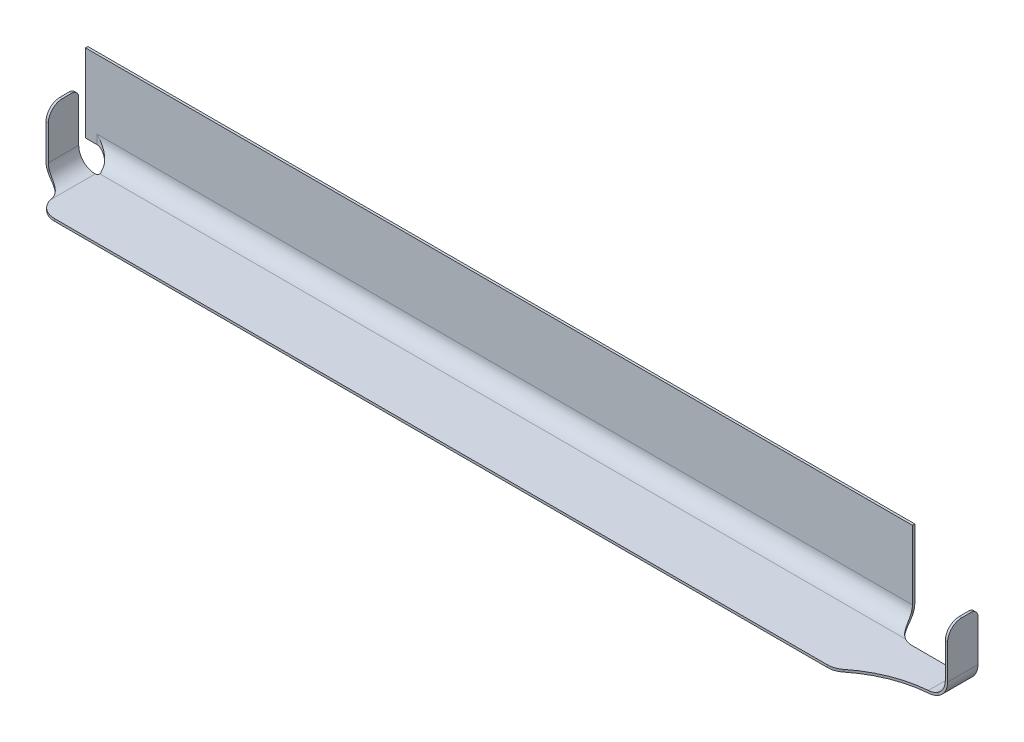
ISO-10303-21;
HEADER;
FILE_DESCRIPTION(('STEP AP214'),'2;1');
FILE_NAME('part.step','',(''),(''),'','','');
FILE_SCHEMA(('AUTOMOTIVE_DESIGN { 1 0 10303 214 1 1 1 1 }'));
ENDSEC;
DATA;
#1=APPLICATION_CONTEXT('core data for automotive mechanical design processes');
#2=APPLICATION_PROTOCOL_DEFINITION('international standard','automotive_design',2000,#1);
#3=PRODUCT_CONTEXT('',#1,'mechanical');
#4=PRODUCT('Part','Part','',(#3));
#5=PRODUCT_RELATED_PRODUCT_CATEGORY('part','',(#4));
#6=PRODUCT_DEFINITION_FORMATION('','',#4);
#7=PRODUCT_DEFINITION_CONTEXT('part definition',#1,'design');
#8=PRODUCT_DEFINITION('design','',#6,#7);
#9=PRODUCT_DEFINITION_SHAPE('','',#8);
#10=(LENGTH_UNIT() NAMED_UNIT(*) SI_UNIT(.MILLI.,.METRE.));
#11=(NAMED_UNIT(*) PLANE_ANGLE_UNIT() SI_UNIT($,.RADIAN.));
#12=(NAMED_UNIT(*) SI_UNIT($,.STERADIAN.) SOLID_ANGLE_UNIT());
#13=UNCERTAINTY_MEASURE_WITH_UNIT(LENGTH_MEASURE(1.E-05),#10,'distance_accuracy_value','');
#14=(GEOMETRIC_REPRESENTATION_CONTEXT(3) GLOBAL_UNCERTAINTY_ASSIGNED_CONTEXT((#13)) GLOBAL_UNIT_ASSIGNED_CONTEXT((#10,
#11,#12)) REPRESENTATION_CONTEXT('',''));
#15=CARTESIAN_POINT('',(0.,0.,0.));
#16=DIRECTION('',(0.,0.,1.));
#17=DIRECTION('',(1.,0.,0.));
#18=AXIS2_PLACEMENT_3D('',#15,#16,#17);
#19=CARTESIAN_POINT('',(559.816,-94.7482753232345,107.95));
#20=DIRECTION('',(1.,0.,0.));
#21=DIRECTION('',(0.,0.,-1.));
#22=AXIS2_PLACEMENT_3D('',#19,#20,#21);
#23=PLANE('',#22);
#24=DIRECTION('',(0.,-1.,0.));
#25=VECTOR('',#24,1.);
#26=CARTESIAN_POINT('',(559.816,49.5299999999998,3.175));
#27=LINE('',#26,#25);
#28=CARTESIAN_POINT('',(559.816,49.5299999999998,3.175));
#29=VERTEX_POINT('',#28);
#30=CARTESIAN_POINT('',(559.816,-43.1800000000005,3.17499999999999));
#31=VERTEX_POINT('',#30);
#32=EDGE_CURVE('E543',#29,#31,#27,.T.);
#33=ORIENTED_EDGE('',*,*,#32,.T.);
#34=DIRECTION('',(0.,1.,0.));
#35=VECTOR('',#34,1.);
#36=CARTESIAN_POINT('',(559.816,-94.7482753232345,3.175));
#37=LINE('',#36,#35);
#38=CARTESIAN_POINT('',(559.816,-55.4767221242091,3.175));
#39=VERTEX_POINT('',#38);
#40=EDGE_CURVE('E654',#31,#39,#37,.F.);
#41=ORIENTED_EDGE('',*,*,#40,.T.);
#42=CARTESIAN_POINT('',(559.816,-43.1800000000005,25.4));
#43=DIRECTION('',(1.,0.,0.));
#44=DIRECTION('',(0.,0.,-1.));
#45=AXIS2_PLACEMENT_3D('',#42,#43,#44);
#46=CIRCLE('',#45,25.4);
#47=CARTESIAN_POINT('',(559.816,-43.1800000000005,0.));
#48=VERTEX_POINT('',#47);
#49=EDGE_CURVE('E584',#39,#48,#46,.T.);
#50=ORIENTED_EDGE('',*,*,#49,.T.);
#51=DIRECTION('',(0.,-1.,0.));
#52=VECTOR('',#51,1.);
#53=CARTESIAN_POINT('',(559.816,-94.7482753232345,0.));
#54=LINE('',#53,#52);
#55=CARTESIAN_POINT('',(559.816,49.5299999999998,0.));
#56=VERTEX_POINT('',#55);
#57=EDGE_CURVE('E551',#56,#48,#54,.T.);
#58=ORIENTED_EDGE('',*,*,#57,.F.);
#59=DIRECTION('',(0.,0.,1.));
#60=VECTOR('',#59,1.);
#61=CARTESIAN_POINT('',(559.816,49.5299999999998,0.));
#62=LINE('',#61,#60);
#63=EDGE_CURVE('E560',#56,#29,#62,.T.);
#64=ORIENTED_EDGE('',*,*,#63,.T.);
#65=EDGE_LOOP('',(#33,#41,#50,#58,#64));
#66=FACE_BOUND('',#65,.T.);
#67=ADVANCED_FACE('F39',(#66),#23,.T.);
#68=CARTESIAN_POINT('',(609.4222,-68.5800000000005,107.95));
#69=DIRECTION('',(0.,0.,-1.));
#70=DIRECTION('',(-1.,0.,0.));
#71=AXIS2_PLACEMENT_3D('',#68,#69,#70);
#72=PLANE('',#71);
#73=DIRECTION('',(-1.,0.,0.));
#74=VECTOR('',#73,1.);
#75=CARTESIAN_POINT('',(609.4222,-68.5800000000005,107.95));
#76=LINE('',#75,#74);
#77=CARTESIAN_POINT('',(550.495367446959,-68.5800000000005,107.95));
#78=VERTEX_POINT('',#77);
#79=CARTESIAN_POINT('',(-489.466015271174,-68.5800000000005,107.95));
#80=VERTEX_POINT('',#79);
#81=EDGE_CURVE('E568',#78,#80,#76,.T.);
#82=ORIENTED_EDGE('',*,*,#81,.F.);
#83=DIRECTION('',(0.,1.,0.));
#84=VECTOR('',#83,1.);
#85=CARTESIAN_POINT('',(550.495367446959,-68.5800000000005,107.95));
#86=LINE('',#85,#84);
#87=CARTESIAN_POINT('',(550.495367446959,-65.4050000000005,107.95));
#88=VERTEX_POINT('',#87);
#89=EDGE_CURVE('E753',#78,#88,#86,.T.);
#90=ORIENTED_EDGE('',*,*,#89,.T.);
#91=DIRECTION('',(-1.,0.,0.));
#92=VECTOR('',#91,1.);
#93=CARTESIAN_POINT('',(609.4222,-65.4050000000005,107.95));
#94=LINE('',#93,#92);
#95=CARTESIAN_POINT('',(-489.466015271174,-65.4050000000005,107.95));
#96=VERTEX_POINT('',#95);
#97=EDGE_CURVE('E569',#88,#96,#94,.T.);
#98=ORIENTED_EDGE('',*,*,#97,.T.);
#99=DIRECTION('',(0.,-1.,0.));
#100=VECTOR('',#99,1.);
#101=CARTESIAN_POINT('',(-489.466015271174,-68.5800000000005,107.95));
#102=LINE('',#101,#100);
#103=EDGE_CURVE('E746',#96,#80,#102,.T.);
#104=ORIENTED_EDGE('',*,*,#103,.T.);
#105=EDGE_LOOP('',(#82,#90,#98,#104));
#106=FACE_BOUND('',#105,.T.);
#107=ADVANCED_FACE('F519',(#106),#72,.F.);
#108=CARTESIAN_POINT('',(609.4222,49.5299999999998,0.));
#109=DIRECTION('',(0.,-1.,0.));
#110=DIRECTION('',(0.,0.,-1.));
#111=AXIS2_PLACEMENT_3D('',#108,#109,#110);
#112=PLANE('',#111);
#113=ORIENTED_EDGE('',*,*,#63,.F.);
#114=DIRECTION('',(-1.,0.,0.));
#115=VECTOR('',#114,1.);
#116=CARTESIAN_POINT('',(609.4222,49.5299999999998,0.));
#117=LINE('',#116,#115);
#118=CARTESIAN_POINT('',(-552.53577788,49.5299999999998,0.));
#119=VERTEX_POINT('',#118);
#120=EDGE_CURVE('E549',#56,#119,#117,.T.);
#121=ORIENTED_EDGE('',*,*,#120,.T.);
#122=DIRECTION('',(0.,0.,-1.));
#123=VECTOR('',#122,1.);
#124=CARTESIAN_POINT('',(-552.53577788,49.5299999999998,0.));
#125=LINE('',#124,#123);
#126=CARTESIAN_POINT('',(-552.53577788,49.5299999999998,3.175));
#127=VERTEX_POINT('',#126);
#128=EDGE_CURVE('E534',#127,#119,#125,.T.);
#129=ORIENTED_EDGE('',*,*,#128,.F.);
#130=DIRECTION('',(-1.,0.,0.));
#131=VECTOR('',#130,1.);
#132=CARTESIAN_POINT('',(609.4222,49.5299999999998,3.175));
#133=LINE('',#132,#131);
#134=EDGE_CURVE('E579',#29,#127,#133,.T.);
#135=ORIENTED_EDGE('',*,*,#134,.F.);
#136=EDGE_LOOP('',(#113,#121,#129,#135));
#137=FACE_BOUND('',#136,.T.);
#138=ADVANCED_FACE('F525',(#137),#112,.F.);
#139=CARTESIAN_POINT('',(609.4222,49.5299999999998,3.175));
#140=DIRECTION('',(0.,0.,-1.));
#141=DIRECTION('',(0.,1.,0.));
#142=AXIS2_PLACEMENT_3D('',#139,#140,#141);
#143=PLANE('',#142);
#144=DIRECTION('',(-1.,0.,0.));
#145=VECTOR('',#144,1.);
#146=CARTESIAN_POINT('',(609.4222,-55.476722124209,3.17499999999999));
#147=LINE('',#146,#145);
#148=CARTESIAN_POINT('',(-537.282644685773,-55.476722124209,3.17499999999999));
#149=VERTEX_POINT('',#148);
#150=CARTESIAN_POINT('',(-552.53577788,-55.476722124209,3.17499999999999));
#151=VERTEX_POINT('',#150);
#152=EDGE_CURVE('E563',#149,#151,#147,.T.);
#153=ORIENTED_EDGE('',*,*,#152,.F.);
#154=DIRECTION('',(0.,1.,0.));
#155=VECTOR('',#154,1.);
#156=CARTESIAN_POINT('',(-537.282644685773,49.5299999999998,3.175));
#157=LINE('',#156,#155);
#158=CARTESIAN_POINT('',(-537.282644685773,-43.1800000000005,3.17499999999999));
#159=VERTEX_POINT('',#158);
#160=EDGE_CURVE('E989',#149,#159,#157,.T.);
#161=ORIENTED_EDGE('',*,*,#160,.T.);
#162=DIRECTION('',(-1.,0.,0.));
#163=VECTOR('',#162,1.);
#164=CARTESIAN_POINT('',(609.4222,-43.1800000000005,3.17499999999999));
#165=LINE('',#164,#163);
#166=EDGE_CURVE('E577',#31,#159,#165,.T.);
#167=ORIENTED_EDGE('',*,*,#166,.F.);
#168=ORIENTED_EDGE('',*,*,#32,.F.);
#169=ORIENTED_EDGE('',*,*,#134,.T.);
#170=DIRECTION('',(0.,1.,0.));
#171=VECTOR('',#170,1.);
#172=CARTESIAN_POINT('',(-552.53577788,49.5299999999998,3.175));
#173=LINE('',#172,#171);
#174=EDGE_CURVE('E536',#151,#127,#173,.T.);
#175=ORIENTED_EDGE('',*,*,#174,.F.);
#176=EDGE_LOOP('',(#153,#161,#167,#168,#169,#175));
#177=FACE_BOUND('',#176,.T.);
#178=ADVANCED_FACE('F649',(#177),#143,.F.);
#179=CARTESIAN_POINT('',(609.4222,-43.1800000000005,25.4));
#180=DIRECTION('',(-1.,0.,0.));
#181=DIRECTION('',(0.,0.,1.));
#182=AXIS2_PLACEMENT_3D('',#179,#180,#181);
#183=CYLINDRICAL_SURFACE('',#182,22.225);
#184=ORIENTED_EDGE('',*,*,#166,.T.);
#185=CARTESIAN_POINT('',(-513.334940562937,-64.7660950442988,20.1093359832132));
#186=CARTESIAN_POINT('',(-513.441645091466,-64.6921132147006,19.8074788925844));
#187=CARTESIAN_POINT('',(-513.553585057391,-64.6122420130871,19.5089986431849));
#188=CARTESIAN_POINT('',(-513.787376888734,-64.4413521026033,18.9192787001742));
#189=CARTESIAN_POINT('',(-513.909226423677,-64.3503360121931,18.6280373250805));
#190=CARTESIAN_POINT('',(-514.288358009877,-64.0618577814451,17.766877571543));
#191=CARTESIAN_POINT('',(-514.55966773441,-63.848655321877,17.2082748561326));
#192=CARTESIAN_POINT('',(-515.131860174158,-63.3879882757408,16.1302663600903));
#193=CARTESIAN_POINT('',(-515.432392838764,-63.1409175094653,15.6105031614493));
#194=CARTESIAN_POINT('',(-516.061447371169,-62.6153170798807,14.6045703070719));
#195=CARTESIAN_POINT('',(-516.389985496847,-62.3367691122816,14.1184204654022));
#196=CARTESIAN_POINT('',(-517.158581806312,-61.6775466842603,13.0600819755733));
#197=CARTESIAN_POINT('',(-517.605615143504,-61.2890134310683,12.497850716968));
#198=CARTESIAN_POINT('',(-518.530979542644,-60.4765971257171,11.4275285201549));
#199=CARTESIAN_POINT('',(-519.009314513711,-60.052709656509,10.9194443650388));
#200=CARTESIAN_POINT('',(-519.994253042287,-59.1735499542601,9.95378684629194));
#201=CARTESIAN_POINT('',(-520.50098915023,-58.7181277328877,9.49648626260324));
#202=CARTESIAN_POINT('',(-521.535764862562,-57.7831293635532,8.63384706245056));
#203=CARTESIAN_POINT('',(-522.06380578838,-57.303551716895,8.22851167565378));
#204=CARTESIAN_POINT('',(-523.3362303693,-56.1432201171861,7.3271684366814));
#205=CARTESIAN_POINT('',(-524.088307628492,-55.4537418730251,6.85317943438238));
#206=CARTESIAN_POINT('',(-525.617236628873,-54.0466434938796,5.9952057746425));
#207=CARTESIAN_POINT('',(-526.394098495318,-53.3290118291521,5.61125845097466));
#208=CARTESIAN_POINT('',(-527.96510067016,-51.8738715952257,4.93022387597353));
#209=CARTESIAN_POINT('',(-528.759220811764,-51.136386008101,4.63304054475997));
#210=CARTESIAN_POINT('',(-530.359996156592,-49.6470462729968,4.12213692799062));
#211=CARTESIAN_POINT('',(-531.166646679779,-48.8951974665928,3.90838622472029));
#212=CARTESIAN_POINT('',(-532.85193762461,-47.3225779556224,3.54844249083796));
#213=CARTESIAN_POINT('',(-533.731258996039,-46.5010294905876,3.40886895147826));
#214=CARTESIAN_POINT('',(-535.493627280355,-44.8534687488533,3.22261863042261));
#215=CARTESIAN_POINT('',(-536.376667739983,-44.0274637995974,3.17581941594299));
#216=CARTESIAN_POINT('',(-537.267126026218,-43.194516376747,3.17500355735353));
#217=CARTESIAN_POINT('',(-537.274885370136,-43.1872581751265,3.1750000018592));
#218=CARTESIAN_POINT('',(-537.282644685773,-43.1800000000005,3.17499999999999));
#219=B_SPLINE_CURVE_WITH_KNOTS('',3,(#185,#186,#187,#188,#189,#190,#191,#192,#193,#194,#195,
#196,#197,#198,#199,#200,#201,#202,#203,#204,#205,#206,#207,#208,#209,#210,#211,#212,#213,#214,
#215,#216,#217,#218),.UNSPECIFIED.,.F.,.F.,(4,2,2,2,2,2,2,2,2,2,2,2,2,2,2,2,4),(0.,
0.985548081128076,1.97086505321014,3.93743304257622,5.88281668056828,7.82933745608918,
10.2756343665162,12.722237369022,15.1814041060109,17.640723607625,21.0108984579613,
24.3824682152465,27.7502901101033,31.116883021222,34.7477211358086,38.3737644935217,
38.4056392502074),.UNSPECIFIED.);
#220=CARTESIAN_POINT('',(-513.334940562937,-64.7660950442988,20.1093359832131));
#221=VERTEX_POINT('',#220);
#222=EDGE_CURVE('E373',#159,#221,#219,.F.);
#223=ORIENTED_EDGE('',*,*,#222,.T.);
#224=CARTESIAN_POINT('',(-514.0325,-63.3393650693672,16.0431509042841));
#225=CARTESIAN_POINT('',(-514.032500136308,-63.4065473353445,16.1878921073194));
#226=CARTESIAN_POINT('',(-514.029923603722,-63.4721620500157,16.3333457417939));
#227=CARTESIAN_POINT('',(-514.019471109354,-63.6001816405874,16.6254779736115));
#228=CARTESIAN_POINT('',(-514.011594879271,-63.6625863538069,16.7721566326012));
#229=CARTESIAN_POINT('',(-513.979792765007,-63.8448926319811,17.2137789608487));
#230=CARTESIAN_POINT('',(-513.947693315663,-63.9598539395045,17.5102391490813));
#231=CARTESIAN_POINT('',(-513.860720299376,-64.1761549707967,18.1053089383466));
#232=CARTESIAN_POINT('',(-513.805810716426,-64.2774728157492,18.4039212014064));
#233=CARTESIAN_POINT('',(-513.672615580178,-64.4659764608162,19.0003433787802));
#234=CARTESIAN_POINT('',(-513.594335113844,-64.5531653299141,19.2981534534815));
#235=CARTESIAN_POINT('',(-513.413863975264,-64.713689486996,19.8913206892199));
#236=CARTESIAN_POINT('',(-513.311600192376,-64.7869811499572,20.1866674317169));
#237=CARTESIAN_POINT('',(-513.083423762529,-64.9197189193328,20.7712752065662));
#238=CARTESIAN_POINT('',(-512.957511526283,-64.9791652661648,21.060536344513));
#239=CARTESIAN_POINT('',(-512.682930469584,-65.0847427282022,21.6295360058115));
#240=CARTESIAN_POINT('',(-512.534324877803,-65.1309098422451,21.9092984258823));
#241=CARTESIAN_POINT('',(-512.214992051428,-65.211097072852,22.4575400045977));
#242=CARTESIAN_POINT('',(-512.044278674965,-65.245124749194,22.726026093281));
#243=CARTESIAN_POINT('',(-511.806757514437,-65.2825850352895,23.0691031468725));
#244=CARTESIAN_POINT('',(-511.749402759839,-65.2909436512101,23.1498281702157));
#245=CARTESIAN_POINT('',(-511.632742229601,-65.3066442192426,23.3098585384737));
#246=CARTESIAN_POINT('',(-511.573438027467,-65.3139869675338,23.3891649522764));
#247=CARTESIAN_POINT('',(-511.513150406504,-65.3208473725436,23.4677726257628));
#248=B_SPLINE_CURVE_WITH_KNOTS('',3,(#224,#225,#226,#227,#228,#229,#230,#231,#232,#233,#234,
#235,#236,#237,#238,#239,#240,#241,#242,#243,#244,#245,#246,#247),.UNSPECIFIED.,.F.,.F.,(4,2,2,
2,2,2,2,2,2,2,2,4),(0.,0.478658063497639,0.957340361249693,1.91493523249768,2.8740478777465,
3.83295191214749,4.79481795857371,5.756667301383,6.7158840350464,7.67450237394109,
7.9726125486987,8.27048774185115),.UNSPECIFIED.);
#249=CARTESIAN_POINT('',(-511.513150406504,-65.3208473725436,23.4677726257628));
#250=VERTEX_POINT('',#249);
#251=EDGE_CURVE('E332',#221,#250,#248,.T.);
#252=ORIENTED_EDGE('',*,*,#251,.T.);
#253=CARTESIAN_POINT('',(-514.0325,-65.1770452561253,22.225));
#254=CARTESIAN_POINT('',(-513.943682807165,-65.177039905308,22.224990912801));
#255=CARTESIAN_POINT('',(-513.854870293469,-65.1775830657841,22.2287267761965));
#256=CARTESIAN_POINT('',(-513.677889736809,-65.1797268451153,22.243618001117));
#257=CARTESIAN_POINT('',(-513.589721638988,-65.1813273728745,22.2547727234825));
#258=CARTESIAN_POINT('',(-513.414752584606,-65.1855438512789,22.2844138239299));
#259=CARTESIAN_POINT('',(-513.32795014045,-65.1881586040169,22.3028915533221));
#260=CARTESIAN_POINT('',(-513.156248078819,-65.194323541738,22.347021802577));
#261=CARTESIAN_POINT('',(-513.071348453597,-65.1978737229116,22.3726742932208));
#262=CARTESIAN_POINT('',(-512.820348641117,-65.2097867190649,22.460163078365));
#263=CARTESIAN_POINT('',(-512.657843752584,-65.2194146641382,22.5325483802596));
#264=CARTESIAN_POINT('',(-512.347377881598,-65.2409509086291,22.7032574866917));
#265=CARTESIAN_POINT('',(-512.199416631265,-65.2528591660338,22.8015808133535));
#266=CARTESIAN_POINT('',(-511.921065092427,-65.2777104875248,23.0221478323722));
#267=CARTESIAN_POINT('',(-511.790792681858,-65.2906596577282,23.1445398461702));
#268=CARTESIAN_POINT('',(-511.552549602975,-65.3160809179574,23.4094681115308));
#269=CARTESIAN_POINT('',(-511.444583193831,-65.3285529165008,23.5520082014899));
#270=CARTESIAN_POINT('',(-511.253571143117,-65.3516798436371,23.8539575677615));
#271=CARTESIAN_POINT('',(-511.170641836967,-65.3623261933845,24.0134410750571));
#272=CARTESIAN_POINT('',(-511.032834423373,-65.3805247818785,24.3442158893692));
#273=CARTESIAN_POINT('',(-510.977938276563,-65.3880790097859,24.5154995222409));
#274=CARTESIAN_POINT('',(-510.911177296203,-65.3973796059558,24.8064950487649));
#275=CARTESIAN_POINT('',(-510.891066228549,-65.4002228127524,24.9243461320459));
#276=CARTESIAN_POINT('',(-510.864226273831,-65.4040390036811,25.1614471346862));
#277=CARTESIAN_POINT('',(-510.857481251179,-65.4050142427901,25.280695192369));
#278=CARTESIAN_POINT('',(-510.8575,-65.4050000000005,25.4));
#279=B_SPLINE_CURVE_WITH_KNOTS('',3,(#253,#254,#255,#256,#257,#258,#259,#260,#261,#262,#263,
#264,#265,#266,#267,#268,#269,#270,#271,#272,#273,#274,#275,#276,#277,#278),.UNSPECIFIED.,.F.,
.F.,(4,2,2,2,2,2,2,2,2,2,2,2,4),(0.,0.266363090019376,0.532703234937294,0.798729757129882,
1.06475519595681,1.59649416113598,2.12822333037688,2.66333816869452,3.19855508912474,
3.73622193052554,4.27354234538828,4.63158555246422,4.98919626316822),.UNSPECIFIED.);
#280=CARTESIAN_POINT('',(-510.8575,-65.4050000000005,25.4));
#281=VERTEX_POINT('',#280);
#282=EDGE_CURVE('E303',#250,#281,#279,.T.);
#283=ORIENTED_EDGE('',*,*,#282,.T.);
#284=DIRECTION('',(-1.,0.,0.));
#285=VECTOR('',#284,1.);
#286=CARTESIAN_POINT('',(609.4222,-65.4050000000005,25.4));
#287=LINE('',#286,#285);
#288=CARTESIAN_POINT('',(572.919277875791,-65.4050000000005,25.4));
#289=VERTEX_POINT('',#288);
#290=EDGE_CURVE('E572',#289,#281,#287,.T.);
#291=ORIENTED_EDGE('',*,*,#290,.F.);
#292=CARTESIAN_POINT('',(572.919277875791,-65.4050000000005,25.4));
#293=CARTESIAN_POINT('',(572.653016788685,-65.4049960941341,25.2526823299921));
#294=CARTESIAN_POINT('',(572.389426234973,-65.4035353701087,25.1005912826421));
#295=CARTESIAN_POINT('',(571.867892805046,-65.3971003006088,24.7870484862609));
#296=CARTESIAN_POINT('',(571.609950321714,-65.3921257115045,24.6255960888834));
#297=CARTESIAN_POINT('',(570.844841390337,-65.3710238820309,24.1273328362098));
#298=CARTESIAN_POINT('',(570.346674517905,-65.348717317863,23.776771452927));
#299=CARTESIAN_POINT('',(569.374604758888,-65.282376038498,23.0391604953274));
#300=CARTESIAN_POINT('',(568.900877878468,-65.2382029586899,22.6518914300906));
#301=CARTESIAN_POINT('',(567.984472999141,-65.1227748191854,21.8460093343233));
#302=CARTESIAN_POINT('',(567.54178782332,-65.0515260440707,21.427403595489));
#303=CARTESIAN_POINT('',(566.68799618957,-64.8761726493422,20.5602109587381));
#304=CARTESIAN_POINT('',(566.277103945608,-64.7718658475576,20.1114533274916));
#305=CARTESIAN_POINT('',(565.493115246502,-64.525574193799,19.191645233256));
#306=CARTESIAN_POINT('',(565.120021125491,-64.3835870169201,18.7205933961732));
#307=CARTESIAN_POINT('',(564.415722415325,-64.0583785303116,17.7647050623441));
#308=CARTESIAN_POINT('',(564.08435849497,-63.8753219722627,17.2799302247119));
#309=CARTESIAN_POINT('',(563.463645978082,-63.4646282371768,16.3024572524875));
#310=CARTESIAN_POINT('',(563.174290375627,-63.2369985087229,15.8097604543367));
#311=CARTESIAN_POINT('',(562.670689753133,-62.7659772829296,14.8844835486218));
#312=CARTESIAN_POINT('',(562.451591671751,-62.5278417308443,14.4518562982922));
#313=CARTESIAN_POINT('',(562.045798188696,-62.0157934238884,13.5926497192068));
#314=CARTESIAN_POINT('',(561.859100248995,-61.7418834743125,13.1660699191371));
#315=CARTESIAN_POINT('',(561.516630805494,-61.1587366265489,12.3241378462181));
#316=CARTESIAN_POINT('',(561.360890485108,-60.849464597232,11.9087972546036));
#317=CARTESIAN_POINT('',(561.078488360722,-60.1973128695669,11.0949805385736));
#318=CARTESIAN_POINT('',(560.951826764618,-59.8544329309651,10.6965045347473));
#319=CARTESIAN_POINT('',(560.73061308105,-59.1552492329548,9.94058024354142));
#320=CARTESIAN_POINT('',(560.634764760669,-58.800492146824,9.58207636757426));
#321=CARTESIAN_POINT('',(560.464199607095,-58.0646896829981,8.88780792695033));
#322=CARTESIAN_POINT('',(560.389481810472,-57.6836455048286,8.55204232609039));
#323=CARTESIAN_POINT('',(560.258320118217,-56.897555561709,7.90605454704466));
#324=CARTESIAN_POINT('',(560.20187618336,-56.4925098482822,7.59583231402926));
#325=CARTESIAN_POINT('',(560.104351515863,-55.6607890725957,7.00322528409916));
#326=CARTESIAN_POINT('',(560.06327163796,-55.2341128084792,6.72084203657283));
#327=CARTESIAN_POINT('',(559.990380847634,-54.3208262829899,6.1608302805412));
#328=CARTESIAN_POINT('',(559.959792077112,-53.8323380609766,5.88610266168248));
#329=CARTESIAN_POINT('',(559.910071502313,-52.8355201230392,5.37412753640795));
#330=CARTESIAN_POINT('',(559.89094071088,-52.3271886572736,5.13688334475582));
#331=CARTESIAN_POINT('',(559.860965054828,-51.2937330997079,4.70138963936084));
#332=CARTESIAN_POINT('',(559.850122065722,-50.7686052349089,4.50314895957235));
#333=CARTESIAN_POINT('',(559.833976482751,-49.7048327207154,4.14695935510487));
#334=CARTESIAN_POINT('',(559.82867321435,-49.1661897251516,3.98900552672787));
#335=CARTESIAN_POINT('',(559.822023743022,-48.1778082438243,3.73937109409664));
#336=CARTESIAN_POINT('',(559.820132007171,-47.7297848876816,3.64085647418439));
#337=CARTESIAN_POINT('',(559.817592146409,-46.8285428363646,3.47173203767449));
#338=CARTESIAN_POINT('',(559.816943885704,-46.3753247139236,3.40111917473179));
#339=CARTESIAN_POINT('',(559.816188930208,-45.4659637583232,3.28813409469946));
#340=CARTESIAN_POINT('',(559.816081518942,-45.0098255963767,3.24572458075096));
#341=CARTESIAN_POINT('',(559.816012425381,-44.3243423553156,3.203298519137));
#342=CARTESIAN_POINT('',(559.816004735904,-44.095608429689,3.19268786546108));
#343=CARTESIAN_POINT('',(559.815999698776,-43.6379212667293,3.17853861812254));
#344=CARTESIAN_POINT('',(559.816002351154,-43.4089680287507,3.17500004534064));
#345=CARTESIAN_POINT('',(559.816,-43.1800000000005,3.17499999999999));
#346=B_SPLINE_CURVE_WITH_KNOTS('',3,(#292,#293,#294,#295,#296,#297,#298,#299,#300,#301,#302,
#303,#304,#305,#306,#307,#308,#309,#310,#311,#312,#313,#314,#315,#316,#317,#318,#319,#320,#321,
#322,#323,#324,#325,#326,#327,#328,#329,#330,#331,#332,#333,#334,#335,#336,#337,#338,#339,#340,
#341,#342,#343,#344,#345),.UNSPECIFIED.,.F.,.F.,(4,2,2,2,2,2,2,2,2,2,2,2,2,2,2,2,2,2,2,2,2,2,2,
2,2,2,4),(0.,0.912787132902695,1.82563755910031,3.65229956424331,5.49067078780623,
7.32861556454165,9.17802543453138,11.0275494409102,12.869782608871,14.7117081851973,
16.3303439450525,17.9488528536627,19.5689839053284,21.1891265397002,22.7276429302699,
24.26608916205,25.8045320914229,27.34306059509,29.0251112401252,30.707310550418,
32.3898904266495,34.0722654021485,35.4476065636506,36.8227975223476,38.1961662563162,
38.8830114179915,39.5698586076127),.UNSPECIFIED.);
#347=EDGE_CURVE('E491',#289,#31,#346,.T.);
#348=ORIENTED_EDGE('',*,*,#347,.T.);
#349=EDGE_LOOP('',(#184,#223,#252,#283,#291,#348));
#350=FACE_BOUND('',#349,.T.);
#351=ADVANCED_FACE('F313',(#350),#183,.F.);
#352=CARTESIAN_POINT('',(609.4222,-65.4050000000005,25.4));
#353=DIRECTION('',(0.,-1.,0.));
#354=DIRECTION('',(0.,0.,-1.));
#355=AXIS2_PLACEMENT_3D('',#352,#353,#354);
#356=PLANE('',#355);
#357=ORIENTED_EDGE('',*,*,#97,.F.);
#358=CARTESIAN_POINT('',(550.495367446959,-65.4050000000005,82.55));
#359=DIRECTION('',(0.,-1.,0.));
#360=DIRECTION('',(0.,0.,-1.));
#361=AXIS2_PLACEMENT_3D('',#358,#359,#360);
#362=CIRCLE('',#361,25.4);
#363=CARTESIAN_POINT('',(566.383305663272,-65.4050000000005,102.367502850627));
#364=VERTEX_POINT('',#363);
#365=EDGE_CURVE('E473',#88,#364,#362,.F.);
#366=ORIENTED_EDGE('',*,*,#365,.T.);
#367=CARTESIAN_POINT('',(660.209712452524,-65.4050000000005,219.4));
#368=DIRECTION('',(0.,-1.,0.));
#369=DIRECTION('',(0.,0.,-1.));
#370=AXIS2_PLACEMENT_3D('',#367,#368,#369);
#371=CIRCLE('',#370,150.);
#372=CARTESIAN_POINT('',(648.0175,-65.4050000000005,69.8963212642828));
#373=VERTEX_POINT('',#372);
#374=EDGE_CURVE('E413',#364,#373,#371,.T.);
#375=ORIENTED_EDGE('',*,*,#374,.T.);
#376=DIRECTION('',(0.,0.,-1.));
#377=VECTOR('',#376,1.);
#378=CARTESIAN_POINT('',(648.0175,-65.4050000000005,69.4));
#379=LINE('',#378,#377);
#380=CARTESIAN_POINT('',(648.0175,-65.4050000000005,28.575));
#381=VERTEX_POINT('',#380);
#382=EDGE_CURVE('E595',#373,#381,#379,.T.);
#383=ORIENTED_EDGE('',*,*,#382,.T.);
#384=DIRECTION('',(-1.,0.,0.));
#385=VECTOR('',#384,1.);
#386=CARTESIAN_POINT('',(609.4222,-65.4050000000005,28.575));
#387=LINE('',#386,#385);
#388=CARTESIAN_POINT('',(585.216,-65.4050000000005,28.575));
#389=VERTEX_POINT('',#388);
#390=EDGE_CURVE('E296',#381,#389,#387,.T.);
#391=ORIENTED_EDGE('',*,*,#390,.T.);
#392=CARTESIAN_POINT('',(585.216,-65.4050000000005,3.175));
#393=DIRECTION('',(0.,-1.,0.));
#394=DIRECTION('',(0.,0.,-1.));
#395=AXIS2_PLACEMENT_3D('',#392,#393,#394);
#396=CIRCLE('',#395,25.4);
#397=EDGE_CURVE('E489',#389,#289,#396,.T.);
#398=ORIENTED_EDGE('',*,*,#397,.T.);
#399=ORIENTED_EDGE('',*,*,#290,.T.);
#400=CARTESIAN_POINT('',(-514.0325,-65.4050000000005,25.4));
#401=DIRECTION('',(0.,-1.,0.));
#402=DIRECTION('',(0.,0.,-1.));
#403=AXIS2_PLACEMENT_3D('',#400,#401,#402);
#404=CIRCLE('',#403,3.175);
#405=CARTESIAN_POINT('',(-514.0325,-65.4050000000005,28.575));
#406=VERTEX_POINT('',#405);
#407=EDGE_CURVE('E301',#281,#406,#404,.T.);
#408=ORIENTED_EDGE('',*,*,#407,.T.);
#409=DIRECTION('',(0.,0.,1.));
#410=VECTOR('',#409,1.);
#411=CARTESIAN_POINT('',(-514.0325,-65.4050000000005,25.4));
#412=LINE('',#411,#410);
#413=CARTESIAN_POINT('',(-514.0325,-65.4050000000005,89.0035128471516));
#414=VERTEX_POINT('',#413);
#415=EDGE_CURVE('E556',#406,#414,#412,.T.);
#416=ORIENTED_EDGE('',*,*,#415,.T.);
#417=CARTESIAN_POINT('',(-489.466015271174,-65.4050000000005,82.55));
#418=DIRECTION('',(0.,-1.,0.));
#419=DIRECTION('',(0.,0.,-1.));
#420=AXIS2_PLACEMENT_3D('',#417,#418,#419);
#421=CIRCLE('',#420,25.4);
#422=EDGE_CURVE('E755',#414,#96,#421,.F.);
#423=ORIENTED_EDGE('',*,*,#422,.T.);
#424=EDGE_LOOP('',(#357,#366,#375,#383,#391,#398,#399,#408,#416,#423));
#425=FACE_BOUND('',#424,.T.);
#426=ADVANCED_FACE('F603',(#425),#356,.F.);
#427=CARTESIAN_POINT('',(609.4222,-68.5800000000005,25.4));
#428=DIRECTION('',(0.,1.,0.));
#429=DIRECTION('',(0.,0.,1.));
#430=AXIS2_PLACEMENT_3D('',#427,#428,#429);
#431=PLANE('',#430);
#432=CARTESIAN_POINT('',(660.209712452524,-68.5800000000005,219.4));
#433=DIRECTION('',(0.,1.,0.));
#434=DIRECTION('',(0.,0.,1.));
#435=AXIS2_PLACEMENT_3D('',#432,#433,#434);
#436=CIRCLE('',#435,150.);
#437=CARTESIAN_POINT('',(648.0175,-68.5800000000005,69.8963212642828));
#438=VERTEX_POINT('',#437);
#439=CARTESIAN_POINT('',(566.383305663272,-68.5800000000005,102.367502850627));
#440=VERTEX_POINT('',#439);
#441=EDGE_CURVE('E737',#438,#440,#436,.T.);
#442=ORIENTED_EDGE('',*,*,#441,.T.);
#443=CARTESIAN_POINT('',(550.495367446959,-68.5800000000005,82.55));
#444=DIRECTION('',(0.,1.,0.));
#445=DIRECTION('',(0.,0.,1.));
#446=AXIS2_PLACEMENT_3D('',#443,#444,#445);
#447=CIRCLE('',#446,25.4);
#448=EDGE_CURVE('E740',#440,#78,#447,.F.);
#449=ORIENTED_EDGE('',*,*,#448,.T.);
#450=ORIENTED_EDGE('',*,*,#81,.T.);
#451=CARTESIAN_POINT('',(-489.466015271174,-68.5800000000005,82.55));
#452=DIRECTION('',(0.,1.,0.));
#453=DIRECTION('',(0.,0.,1.));
#454=AXIS2_PLACEMENT_3D('',#451,#452,#453);
#455=CIRCLE('',#454,25.4);
#456=CARTESIAN_POINT('',(-514.0325,-68.5800000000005,89.003512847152));
#457=VERTEX_POINT('',#456);
#458=EDGE_CURVE('E259',#80,#457,#455,.F.);
#459=ORIENTED_EDGE('',*,*,#458,.T.);
#460=DIRECTION('',(0.,0.,-1.));
#461=VECTOR('',#460,1.);
#462=CARTESIAN_POINT('',(-514.0325,-68.5800000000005,69.4));
#463=LINE('',#462,#461);
#464=CARTESIAN_POINT('',(-514.0325,-68.5800000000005,28.575));
#465=VERTEX_POINT('',#464);
#466=EDGE_CURVE('E248',#457,#465,#463,.T.);
#467=ORIENTED_EDGE('',*,*,#466,.T.);
#468=CARTESIAN_POINT('',(-514.0325,-68.5800000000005,25.4));
#469=DIRECTION('',(0.,1.,0.));
#470=DIRECTION('',(0.,0.,1.));
#471=AXIS2_PLACEMENT_3D('',#468,#469,#470);
#472=CIRCLE('',#471,3.175);
#473=CARTESIAN_POINT('',(-510.8575,-68.5800000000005,25.4));
#474=VERTEX_POINT('',#473);
#475=EDGE_CURVE('E251',#465,#474,#472,.T.);
#476=ORIENTED_EDGE('',*,*,#475,.T.);
#477=DIRECTION('',(-1.,0.,0.));
#478=VECTOR('',#477,1.);
#479=CARTESIAN_POINT('',(609.4222,-68.5800000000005,25.4));
#480=LINE('',#479,#478);
#481=CARTESIAN_POINT('',(572.919277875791,-68.5800000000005,25.4));
#482=VERTEX_POINT('',#481);
#483=EDGE_CURVE('E557',#482,#474,#480,.T.);
#484=ORIENTED_EDGE('',*,*,#483,.F.);
#485=CARTESIAN_POINT('',(585.216,-68.5800000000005,3.175));
#486=DIRECTION('',(0.,1.,0.));
#487=DIRECTION('',(0.,0.,1.));
#488=AXIS2_PLACEMENT_3D('',#485,#486,#487);
#489=CIRCLE('',#488,25.4);
#490=CARTESIAN_POINT('',(585.216,-68.5800000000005,28.575));
#491=VERTEX_POINT('',#490);
#492=EDGE_CURVE('E660',#482,#491,#489,.T.);
#493=ORIENTED_EDGE('',*,*,#492,.T.);
#494=DIRECTION('',(1.,0.,0.));
#495=VECTOR('',#494,1.);
#496=CARTESIAN_POINT('',(696.785866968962,-68.5800000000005,28.575));
#497=LINE('',#496,#495);
#498=CARTESIAN_POINT('',(648.0175,-68.5800000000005,28.575));
#499=VERTEX_POINT('',#498);
#500=EDGE_CURVE('E276',#491,#499,#497,.T.);
#501=ORIENTED_EDGE('',*,*,#500,.T.);
#502=DIRECTION('',(0.,0.,-1.));
#503=VECTOR('',#502,1.);
#504=CARTESIAN_POINT('',(648.0175,-68.5800000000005,69.4));
#505=LINE('',#504,#503);
#506=EDGE_CURVE('E555',#438,#499,#505,.T.);
#507=ORIENTED_EDGE('',*,*,#506,.F.);
#508=EDGE_LOOP('',(#442,#449,#450,#459,#467,#476,#484,#493,#501,#507));
#509=FACE_BOUND('',#508,.T.);
#510=ADVANCED_FACE('F255',(#509),#431,.F.);
#511=CARTESIAN_POINT('',(609.4222,-43.1800000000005,25.4));
#512=DIRECTION('',(-1.,0.,0.));
#513=DIRECTION('',(0.,0.,1.));
#514=AXIS2_PLACEMENT_3D('',#511,#512,#513);
#515=CYLINDRICAL_SURFACE('',#514,25.4);
#516=CARTESIAN_POINT('',(-510.8575,-68.5800000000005,25.4));
#517=CARTESIAN_POINT('',(-510.857491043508,-68.5800045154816,25.3110661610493));
#518=CARTESIAN_POINT('',(-510.861236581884,-68.5795330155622,25.2221368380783));
#519=CARTESIAN_POINT('',(-510.876167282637,-68.5776713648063,25.0449211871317));
#520=CARTESIAN_POINT('',(-510.887351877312,-68.5762812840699,24.9566348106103));
#521=CARTESIAN_POINT('',(-510.917075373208,-68.5726178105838,24.7814194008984));
#522=CARTESIAN_POINT('',(-510.935606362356,-68.570345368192,24.6944890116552));
#523=CARTESIAN_POINT('',(-510.979867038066,-68.5649850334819,24.5225319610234));
#524=CARTESIAN_POINT('',(-511.005596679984,-68.5618971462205,24.4375052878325));
#525=CARTESIAN_POINT('',(-511.093357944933,-68.5515293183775,24.1861203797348));
#526=CARTESIAN_POINT('',(-511.16597822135,-68.5431430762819,24.0233616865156));
#527=CARTESIAN_POINT('',(-511.337260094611,-68.5243582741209,23.7124407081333));
#528=CARTESIAN_POINT('',(-511.435920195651,-68.5139598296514,23.5642775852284));
#529=CARTESIAN_POINT('',(-511.657071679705,-68.4922479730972,23.285831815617));
#530=CARTESIAN_POINT('',(-511.77967484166,-68.4809304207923,23.1556381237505));
#531=CARTESIAN_POINT('',(-512.04501112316,-68.4586876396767,22.9176043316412));
#532=CARTESIAN_POINT('',(-512.187748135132,-68.4477624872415,22.8097685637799));
#533=CARTESIAN_POINT('',(-512.489896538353,-68.4274993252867,22.6191678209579));
#534=CARTESIAN_POINT('',(-512.649366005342,-68.4181671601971,22.5364943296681));
#535=CARTESIAN_POINT('',(-512.980027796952,-68.402210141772,22.3991794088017));
#536=CARTESIAN_POINT('',(-513.151212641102,-68.3955835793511,22.3445202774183));
#537=CARTESIAN_POINT('',(-513.441597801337,-68.387441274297,22.2782031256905));
#538=CARTESIAN_POINT('',(-513.558947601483,-68.3849565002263,22.2582684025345));
#539=CARTESIAN_POINT('',(-513.795014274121,-68.3816212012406,22.2316662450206));
#540=CARTESIAN_POINT('',(-513.913729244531,-68.3807686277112,22.2249821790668));
#541=CARTESIAN_POINT('',(-514.0325,-68.3807812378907,22.225));
#542=B_SPLINE_CURVE_WITH_KNOTS('',3,(#516,#517,#518,#519,#520,#521,#522,#523,#524,#525,#526,
#527,#528,#529,#530,#531,#532,#533,#534,#535,#536,#537,#538,#539,#540,#541),.UNSPECIFIED.,.F.,
.F.,(4,2,2,2,2,2,2,2,2,2,2,2,4),(0.,0.266713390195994,0.533406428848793,0.799813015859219,
1.06621795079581,1.59874055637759,2.13123257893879,2.66627269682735,3.20141639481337,
3.73848311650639,4.27521005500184,4.63167139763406,4.98768504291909),.UNSPECIFIED.);
#543=CARTESIAN_POINT('',(-511.513150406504,-68.5063992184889,23.4677726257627));
#544=VERTEX_POINT('',#543);
#545=EDGE_CURVE('E280',#474,#544,#542,.T.);
#546=ORIENTED_EDGE('',*,*,#545,.T.);
#547=CARTESIAN_POINT('',(-511.513150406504,-68.5063992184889,23.4677726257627));
#548=CARTESIAN_POINT('',(-511.610538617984,-68.4967120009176,23.3407931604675));
#549=CARTESIAN_POINT('',(-511.705375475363,-68.4859219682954,23.2119638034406));
#550=CARTESIAN_POINT('',(-511.889817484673,-68.4619841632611,22.9508222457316));
#551=CARTESIAN_POINT('',(-511.979422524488,-68.4488363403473,22.8185099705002));
#552=CARTESIAN_POINT('',(-512.240165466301,-68.4056328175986,22.4167207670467));
#553=CARTESIAN_POINT('',(-512.403259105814,-68.3718143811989,22.1423550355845));
#554=CARTESIAN_POINT('',(-512.706794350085,-68.2931623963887,21.5830911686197));
#555=CARTESIAN_POINT('',(-512.84724650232,-68.2483340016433,21.2981980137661));
#556=CARTESIAN_POINT('',(-513.104855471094,-68.1468754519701,20.7201270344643));
#557=CARTESIAN_POINT('',(-513.222014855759,-68.0902465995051,20.4269501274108));
#558=CARTESIAN_POINT('',(-513.432719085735,-67.9646000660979,19.834443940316));
#559=CARTESIAN_POINT('',(-513.526237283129,-67.8955685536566,19.5351081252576));
#560=CARTESIAN_POINT('',(-513.689372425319,-67.7449246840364,18.9331042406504));
#561=CARTESIAN_POINT('',(-513.75898881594,-67.663312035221,18.6304360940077));
#562=CARTESIAN_POINT('',(-513.874415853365,-67.4877419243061,18.0248456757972));
#563=CARTESIAN_POINT('',(-513.920273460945,-67.3938092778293,17.7219251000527));
#564=CARTESIAN_POINT('',(-513.988893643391,-67.1938171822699,17.1176223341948));
#565=CARTESIAN_POINT('',(-514.011668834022,-67.087764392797,16.8162393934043));
#566=CARTESIAN_POINT('',(-514.026384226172,-66.9463665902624,16.4374672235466));
#567=CARTESIAN_POINT('',(-514.028683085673,-66.9163864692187,16.3583671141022));
#568=CARTESIAN_POINT('',(-514.031740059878,-66.8556533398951,16.2005122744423));
#569=CARTESIAN_POINT('',(-514.032499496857,-66.8249010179,16.1217573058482));
#570=CARTESIAN_POINT('',(-514.0325,-66.7937539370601,16.043150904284));
#571=B_SPLINE_CURVE_WITH_KNOTS('',3,(#547,#548,#549,#550,#551,#552,#553,#554,#555,#556,#557,
#558,#559,#560,#561,#562,#563,#564,#565,#566,#567,#568,#569,#570),.UNSPECIFIED.,.F.,.F.,(4,2,2,
2,2,2,2,2,2,2,2,4),(0.,0.480884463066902,0.961779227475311,1.92343128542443,2.88463405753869,
3.84573079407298,4.80790607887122,5.77010367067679,6.73039209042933,7.69015537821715,
7.9440114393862,8.19764936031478),.UNSPECIFIED.);
#572=CARTESIAN_POINT('',(-513.334940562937,-68.0228837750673,20.1093359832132));
#573=VERTEX_POINT('',#572);
#574=EDGE_CURVE('E357',#544,#573,#571,.T.);
#575=ORIENTED_EDGE('',*,*,#574,.T.);
#576=CARTESIAN_POINT('',(-513.334940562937,-68.0228837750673,20.1093359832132));
#577=CARTESIAN_POINT('',(-513.449579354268,-67.9538241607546,19.7850187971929));
#578=CARTESIAN_POINT('',(-513.570414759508,-67.8788518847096,19.464189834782));
#579=CARTESIAN_POINT('',(-513.823867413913,-67.7178047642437,18.8301457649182));
#580=CARTESIAN_POINT('',(-513.956481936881,-67.6317324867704,18.5169289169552));
#581=CARTESIAN_POINT('',(-514.232687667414,-67.4493388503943,17.8991492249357));
#582=CARTESIAN_POINT('',(-514.376258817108,-67.3530360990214,17.5945719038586));
#583=CARTESIAN_POINT('',(-514.673991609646,-67.1507828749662,16.9939292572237));
#584=CARTESIAN_POINT('',(-514.828153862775,-67.0448318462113,16.6978644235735));
#585=CARTESIAN_POINT('',(-515.301163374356,-66.7167087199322,15.8312429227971));
#586=CARTESIAN_POINT('',(-515.634535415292,-66.4816034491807,15.2733722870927));
#587=CARTESIAN_POINT('',(-516.336179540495,-65.9820616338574,14.1937407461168));
#588=CARTESIAN_POINT('',(-516.704470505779,-65.7176092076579,13.6719996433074));
#589=CARTESIAN_POINT('',(-517.553573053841,-65.1060783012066,12.5590115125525));
#590=CARTESIAN_POINT('',(-518.041699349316,-64.7533599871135,11.9764337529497));
#591=CARTESIAN_POINT('',(-519.058503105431,-64.0214486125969,10.8660268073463));
#592=CARTESIAN_POINT('',(-519.587186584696,-63.6422516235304,10.3382057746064));
#593=CARTESIAN_POINT('',(-520.68699486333,-62.8619283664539,9.33166645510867));
#594=CARTESIAN_POINT('',(-521.258501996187,-62.4606158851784,8.8535123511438));
#595=CARTESIAN_POINT('',(-522.436817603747,-61.6486711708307,7.95190974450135));
#596=CARTESIAN_POINT('',(-523.043621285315,-61.2380402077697,7.52845383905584));
#597=CARTESIAN_POINT('',(-523.987036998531,-60.6180100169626,6.92945326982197));
#598=CARTESIAN_POINT('',(-524.310864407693,-60.4082804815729,6.73383894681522));
#599=CARTESIAN_POINT('',(-524.967787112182,-59.9905979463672,6.35681532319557));
#600=CARTESIAN_POINT('',(-525.300881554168,-59.7826447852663,6.17540472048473));
#601=CARTESIAN_POINT('',(-525.976884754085,-59.3701034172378,5.82671305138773));
#602=CARTESIAN_POINT('',(-526.319801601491,-59.1655182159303,5.65944410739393));
#603=CARTESIAN_POINT('',(-527.015530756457,-58.7620001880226,5.33940287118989));
#604=CARTESIAN_POINT('',(-527.368341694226,-58.5630665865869,5.18662858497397));
#605=CARTESIAN_POINT('',(-528.079090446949,-58.1762017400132,4.89801719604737));
#606=CARTESIAN_POINT('',(-528.436874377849,-57.9881509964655,4.7619623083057));
#607=CARTESIAN_POINT('',(-529.163171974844,-57.6227673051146,4.50463211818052));
#608=CARTESIAN_POINT('',(-529.531686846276,-57.4454355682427,4.38335848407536));
#609=CARTESIAN_POINT('',(-530.279420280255,-57.1052236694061,4.15641515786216));
#610=CARTESIAN_POINT('',(-530.658623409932,-56.9423239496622,4.05072421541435));
#611=CARTESIAN_POINT('',(-531.428418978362,-56.6349136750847,3.85566348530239));
#612=CARTESIAN_POINT('',(-531.819006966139,-56.4903960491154,3.76628741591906));
#613=CARTESIAN_POINT('',(-532.614730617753,-56.2234385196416,3.60428240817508));
#614=CARTESIAN_POINT('',(-533.019957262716,-56.1011833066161,3.53179228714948));
#615=CARTESIAN_POINT('',(-533.840783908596,-55.8856461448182,3.40585925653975));
#616=CARTESIAN_POINT('',(-534.256374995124,-55.7923401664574,3.35240054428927));
#617=CARTESIAN_POINT('',(-534.889890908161,-55.6771543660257,3.28703782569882));
#618=CARTESIAN_POINT('',(-535.104815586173,-55.6426854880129,3.26761123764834));
#619=CARTESIAN_POINT('',(-535.536388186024,-55.5831195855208,3.23417505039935));
#620=CARTESIAN_POINT('',(-535.753036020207,-55.558022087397,3.22016517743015));
#621=CARTESIAN_POINT('',(-536.188170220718,-55.5176007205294,3.1976538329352));
#622=CARTESIAN_POINT('',(-536.40666011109,-55.5023056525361,3.1891685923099));
#623=CARTESIAN_POINT('',(-536.844310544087,-55.4818485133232,3.17783655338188));
#624=CARTESIAN_POINT('',(-537.063471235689,-55.4766888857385,3.17499111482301));
#625=CARTESIAN_POINT('',(-537.282644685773,-55.476722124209,3.17499999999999));
#626=B_SPLINE_CURVE_WITH_KNOTS('',3,(#576,#577,#578,#579,#580,#581,#582,#583,#584,#585,#586,
#587,#588,#589,#590,#591,#592,#593,#594,#595,#596,#597,#598,#599,#600,#601,#602,#603,#604,#605,
#606,#607,#608,#609,#610,#611,#612,#613,#614,#615,#616,#617,#618,#619,#620,#621,#622,#623,#624,
#625),.UNSPECIFIED.,.F.,.F.,(4,2,2,2,2,2,2,2,2,2,2,2,2,2,2,2,2,2,2,2,2,2,2,2,4),(0.,
1.05236266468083,2.10448239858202,3.15472024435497,4.20501865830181,6.27542081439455,
8.34694891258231,10.8570312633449,13.3674868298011,15.9039016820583,18.4399728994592,
19.7374066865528,21.0347213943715,22.3331371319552,23.6313739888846,24.9103364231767,
26.1894430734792,27.4667889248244,28.7436419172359,30.0306479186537,31.3165827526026,
31.9719607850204,32.6273056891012,33.2845673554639,33.9419874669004),.UNSPECIFIED.);
#627=EDGE_CURVE('E364',#573,#149,#626,.T.);
#628=ORIENTED_EDGE('',*,*,#627,.T.);
#629=ORIENTED_EDGE('',*,*,#152,.T.);
#630=CARTESIAN_POINT('',(-552.53577788,-43.1800000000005,25.4));
#631=DIRECTION('',(-1.,0.,0.));
#632=DIRECTION('',(0.,0.,1.));
#633=AXIS2_PLACEMENT_3D('',#630,#631,#632);
#634=CIRCLE('',#633,25.4);
#635=CARTESIAN_POINT('',(-552.53577788,-43.1800000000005,0.));
#636=VERTEX_POINT('',#635);
#637=EDGE_CURVE('E578',#636,#151,#634,.T.);
#638=ORIENTED_EDGE('',*,*,#637,.F.);
#639=DIRECTION('',(-1.,0.,0.));
#640=VECTOR('',#639,1.);
#641=CARTESIAN_POINT('',(609.4222,-43.1800000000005,0.));
#642=LINE('',#641,#640);
#643=EDGE_CURVE('E552',#48,#636,#642,.T.);
#644=ORIENTED_EDGE('',*,*,#643,.F.);
#645=ORIENTED_EDGE('',*,*,#49,.F.);
#646=CARTESIAN_POINT('',(559.816,-55.4767221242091,3.175));
#647=CARTESIAN_POINT('',(559.816003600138,-55.7483619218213,3.32529370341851));
#648=CARTESIAN_POINT('',(559.817333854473,-56.0172216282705,3.48055504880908));
#649=CARTESIAN_POINT('',(559.823204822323,-56.5490591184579,3.80081848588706));
#650=CARTESIAN_POINT('',(559.827745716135,-56.8120365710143,3.96582112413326));
#651=CARTESIAN_POINT('',(559.847024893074,-57.5918154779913,4.47525226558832));
#652=CARTESIAN_POINT('',(559.867420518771,-58.0992560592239,4.83398921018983));
#653=CARTESIAN_POINT('',(559.928116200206,-59.0881757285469,5.5889200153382));
#654=CARTESIAN_POINT('',(559.968514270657,-59.5695138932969,5.98529047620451));
#655=CARTESIAN_POINT('',(560.074127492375,-60.5002142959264,6.81083833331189));
#656=CARTESIAN_POINT('',(560.139337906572,-60.9495826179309,7.24000945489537));
#657=CARTESIAN_POINT('',(560.299780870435,-61.8153820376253,8.12951556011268));
#658=CARTESIAN_POINT('',(560.395163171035,-62.2316355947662,8.5899967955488));
#659=CARTESIAN_POINT('',(560.620398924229,-63.0256440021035,9.53521720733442));
#660=CARTESIAN_POINT('',(560.750254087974,-63.4033969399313,10.0199575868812));
#661=CARTESIAN_POINT('',(561.047865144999,-64.1166599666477,11.0060651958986));
#662=CARTESIAN_POINT('',(561.215498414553,-64.4523013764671,11.507374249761));
#663=CARTESIAN_POINT('',(561.591832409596,-65.0809437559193,12.5211688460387));
#664=CARTESIAN_POINT('',(561.800528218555,-65.3739498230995,13.0336530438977));
#665=CARTESIAN_POINT('',(562.239931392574,-65.8921129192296,14.0158047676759));
#666=CARTESIAN_POINT('',(562.466947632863,-66.1210079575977,14.4851583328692));
#667=CARTESIAN_POINT('',(562.956799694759,-66.5433272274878,15.4210975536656));
#668=CARTESIAN_POINT('',(563.219633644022,-66.7367533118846,15.8876833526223));
#669=CARTESIAN_POINT('',(563.780938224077,-67.0895464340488,16.8128584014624));
#670=CARTESIAN_POINT('',(564.079442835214,-67.2488805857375,17.2714395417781));
#671=CARTESIAN_POINT('',(564.710685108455,-67.5353261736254,18.174857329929));
#672=CARTESIAN_POINT('',(565.043422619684,-67.6624377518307,18.6196940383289));
#673=CARTESIAN_POINT('',(565.729817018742,-67.8834791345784,19.4765350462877));
#674=CARTESIAN_POINT('',(566.082421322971,-67.9783654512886,19.8891383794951));
#675=CARTESIAN_POINT('',(566.816026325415,-68.143519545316,20.6934841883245));
#676=CARTESIAN_POINT('',(567.197028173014,-68.213786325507,21.0852258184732));
#677=CARTESIAN_POINT('',(567.985176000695,-68.3328865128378,21.8447125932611));
#678=CARTESIAN_POINT('',(568.392316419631,-68.3817244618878,22.2124628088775));
#679=CARTESIAN_POINT('',(569.230491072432,-68.4613042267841,22.9215143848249));
#680=CARTESIAN_POINT('',(569.661520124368,-68.4920499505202,23.2628214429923));
#681=CARTESIAN_POINT('',(570.552430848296,-68.5391736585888,23.9223299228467));
#682=CARTESIAN_POINT('',(571.012665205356,-68.5553124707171,24.2400711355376));
#683=CARTESIAN_POINT('',(571.952100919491,-68.5756949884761,24.8438856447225));
#684=CARTESIAN_POINT('',(572.43125213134,-68.5799682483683,25.1300359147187));
#685=CARTESIAN_POINT('',(572.919277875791,-68.5800000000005,25.4));
#686=B_SPLINE_CURVE_WITH_KNOTS('',3,(#646,#647,#648,#649,#650,#651,#652,#653,#654,#655,#656,
#657,#658,#659,#660,#661,#662,#663,#664,#665,#666,#667,#668,#669,#670,#671,#672,#673,#674,#675,
#676,#677,#678,#679,#680,#681,#682,#683,#684,#685),.UNSPECIFIED.,.F.,.F.,(4,2,2,2,2,2,2,2,2,2,2,
2,2,2,2,2,2,2,2,4),(0.,0.931223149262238,1.86249859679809,3.72575880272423,5.59824096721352,
7.47036582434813,9.35193229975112,11.2335921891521,13.1092301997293,14.9846437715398,
16.6906523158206,18.3965717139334,20.1041293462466,21.8116794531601,23.4628846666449,
25.1141567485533,26.7650786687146,28.4156438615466,30.0927704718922,31.7657159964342),.UNSPECIFIED.);
#687=EDGE_CURVE('E498',#39,#482,#686,.T.);
#688=ORIENTED_EDGE('',*,*,#687,.T.);
#689=ORIENTED_EDGE('',*,*,#483,.T.);
#690=EDGE_LOOP('',(#546,#575,#628,#629,#638,#644,#645,#688,#689));
#691=FACE_BOUND('',#690,.T.);
#692=ADVANCED_FACE('F342',(#691),#515,.T.);
#693=CARTESIAN_POINT('',(609.4222,49.5299999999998,0.));
#694=DIRECTION('',(0.,0.,1.));
#695=DIRECTION('',(0.,-1.,0.));
#696=AXIS2_PLACEMENT_3D('',#693,#694,#695);
#697=PLANE('',#696);
#698=ORIENTED_EDGE('',*,*,#120,.F.);
#699=ORIENTED_EDGE('',*,*,#57,.T.);
#700=ORIENTED_EDGE('',*,*,#643,.T.);
#701=DIRECTION('',(0.,1.,0.));
#702=VECTOR('',#701,1.);
#703=CARTESIAN_POINT('',(-552.53577788,-77.8227707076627,0.));
#704=LINE('',#703,#702);
#705=EDGE_CURVE('E539',#636,#119,#704,.T.);
#706=ORIENTED_EDGE('',*,*,#705,.T.);
#707=EDGE_LOOP('',(#698,#699,#700,#706));
#708=FACE_BOUND('',#707,.T.);
#709=ADVANCED_FACE('F349',(#708),#697,.F.);
#710=CARTESIAN_POINT('',(-552.53577788,-77.8227707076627,107.95));
#711=DIRECTION('',(-1.,0.,0.));
#712=DIRECTION('',(0.,0.,1.));
#713=AXIS2_PLACEMENT_3D('',#710,#711,#712);
#714=PLANE('',#713);
#715=ORIENTED_EDGE('',*,*,#128,.T.);
#716=ORIENTED_EDGE('',*,*,#705,.F.);
#717=ORIENTED_EDGE('',*,*,#637,.T.);
#718=ORIENTED_EDGE('',*,*,#174,.T.);
#719=EDGE_LOOP('',(#715,#716,#717,#718));
#720=FACE_BOUND('',#719,.T.);
#721=ADVANCED_FACE('F438',(#720),#714,.T.);
#722=CARTESIAN_POINT('',(648.0175,-43.1800000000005,69.4));
#723=DIRECTION('',(0.,0.,-1.));
#724=DIRECTION('',(-1.,0.,0.));
#725=AXIS2_PLACEMENT_3D('',#722,#723,#724);
#726=CYLINDRICAL_SURFACE('',#725,25.4);
#727=ORIENTED_EDGE('',*,*,#506,.T.);
#728=CARTESIAN_POINT('',(648.0175,-43.1800000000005,28.575));
#729=DIRECTION('',(0.,0.,1.));
#730=DIRECTION('',(1.,0.,0.));
#731=AXIS2_PLACEMENT_3D('',#728,#729,#730);
#732=CIRCLE('',#731,25.4);
#733=CARTESIAN_POINT('',(673.4175,-43.1800000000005,28.575));
#734=VERTEX_POINT('',#733);
#735=EDGE_CURVE('E294',#499,#734,#732,.T.);
#736=ORIENTED_EDGE('',*,*,#735,.T.);
#737=DIRECTION('',(0.,0.,-1.));
#738=VECTOR('',#737,1.);
#739=CARTESIAN_POINT('',(673.4175,-43.1800000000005,69.4));
#740=LINE('',#739,#738);
#741=CARTESIAN_POINT('',(673.4175,-43.1800000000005,69.4));
#742=VERTEX_POINT('',#741);
#743=EDGE_CURVE('E617',#742,#734,#740,.T.);
#744=ORIENTED_EDGE('',*,*,#743,.F.);
#745=CARTESIAN_POINT('',(648.0175,-43.1800000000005,69.4));
#746=DIRECTION('',(0.,0.,1.));
#747=DIRECTION('',(1.,0.,0.));
#748=AXIS2_PLACEMENT_3D('',#745,#746,#747);
#749=CIRCLE('',#748,25.4);
#750=CARTESIAN_POINT('',(660.209712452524,-65.4625033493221,69.4));
#751=VERTEX_POINT('',#750);
#752=EDGE_CURVE('E315',#751,#742,#749,.T.);
#753=ORIENTED_EDGE('',*,*,#752,.F.);
#754=CARTESIAN_POINT('',(660.209712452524,-65.4625033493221,69.4));
#755=CARTESIAN_POINT('',(659.896652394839,-65.6337983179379,69.3999991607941));
#756=CARTESIAN_POINT('',(659.580022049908,-65.7984737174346,69.4009804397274));
#757=CARTESIAN_POINT('',(658.940112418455,-66.1143387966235,69.4050317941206));
#758=CARTESIAN_POINT('',(658.616833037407,-66.2655282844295,69.4081018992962));
#759=CARTESIAN_POINT('',(657.637703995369,-66.6985211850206,69.4206331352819));
#760=CARTESIAN_POINT('',(656.972629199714,-66.9597130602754,69.4334152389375));
#761=CARTESIAN_POINT('',(655.63728701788,-67.4202032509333,69.4682490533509));
#762=CARTESIAN_POINT('',(654.967417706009,-67.6206795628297,69.4901017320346));
#763=CARTESIAN_POINT('',(653.613987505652,-67.9656113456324,69.5435537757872));
#764=CARTESIAN_POINT('',(652.930432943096,-68.1100920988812,69.5751487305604));
#765=CARTESIAN_POINT('',(651.895218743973,-68.2847305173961,69.6302084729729));
#766=CARTESIAN_POINT('',(651.546799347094,-68.3360733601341,69.6499534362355));
#767=CARTESIAN_POINT('',(650.848325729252,-68.4242124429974,69.6919950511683));
#768=CARTESIAN_POINT('',(650.498271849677,-68.4610115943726,69.7142911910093));
#769=CARTESIAN_POINT('',(649.793343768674,-68.5203400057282,69.7616848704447));
#770=CARTESIAN_POINT('',(649.438458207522,-68.5427115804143,69.7868099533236));
#771=CARTESIAN_POINT('',(648.728181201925,-68.572545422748,69.8396391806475));
#772=CARTESIAN_POINT('',(648.372789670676,-68.5800047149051,69.8673438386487));
#773=CARTESIAN_POINT('',(648.0175,-68.5800000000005,69.8963212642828));
#774=B_SPLINE_CURVE_WITH_KNOTS('',3,(#754,#755,#756,#757,#758,#759,#760,#761,#762,#763,#764,
#765,#766,#767,#768,#769,#770,#771,#772,#773),.UNSPECIFIED.,.F.,.F.,(4,2,2,2,2,2,2,2,2,4),(0.,
1.07040633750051,2.14082790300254,4.28189518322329,6.37827663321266,8.47371044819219,
9.53165985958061,10.5893973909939,11.6585078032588,12.7278315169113),.UNSPECIFIED.);
#775=EDGE_CURVE('E396',#751,#438,#774,.T.);
#776=ORIENTED_EDGE('',*,*,#775,.T.);
#777=EDGE_LOOP('',(#727,#736,#744,#753,#776));
#778=FACE_BOUND('',#777,.T.);
#779=ADVANCED_FACE('F433',(#778),#726,.T.);
#780=CARTESIAN_POINT('',(673.4175,-43.1800000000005,69.4));
#781=DIRECTION('',(-1.,0.,0.));
#782=DIRECTION('',(0.,0.,1.));
#783=AXIS2_PLACEMENT_3D('',#780,#781,#782);
#784=PLANE('',#783);
#785=DIRECTION('',(0.,1.,0.));
#786=VECTOR('',#785,1.);
#787=CARTESIAN_POINT('',(673.4175,-43.1800000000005,28.575));
#788=LINE('',#787,#786);
#789=CARTESIAN_POINT('',(673.4175,12.7749999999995,28.575));
#790=VERTEX_POINT('',#789);
#791=EDGE_CURVE('E286',#734,#790,#788,.T.);
#792=ORIENTED_EDGE('',*,*,#791,.T.);
#793=CARTESIAN_POINT('',(673.4175,12.7749999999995,38.1));
#794=DIRECTION('',(-1.,0.,0.));
#795=DIRECTION('',(0.,0.,1.));
#796=AXIS2_PLACEMENT_3D('',#793,#794,#795);
#797=CIRCLE('',#796,9.525);
#798=CARTESIAN_POINT('',(673.4175,22.2999999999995,38.1));
#799=VERTEX_POINT('',#798);
#800=EDGE_CURVE('E684',#790,#799,#797,.F.);
#801=ORIENTED_EDGE('',*,*,#800,.T.);
#802=DIRECTION('',(0.,0.,-1.));
#803=VECTOR('',#802,1.);
#804=CARTESIAN_POINT('',(673.4175,22.2999999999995,69.4));
#805=LINE('',#804,#803);
#806=CARTESIAN_POINT('',(673.4175,22.2999999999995,50.35));
#807=VERTEX_POINT('',#806);
#808=EDGE_CURVE('E612',#807,#799,#805,.T.);
#809=ORIENTED_EDGE('',*,*,#808,.F.);
#810=CARTESIAN_POINT('',(673.4175,3.2499999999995,50.35));
#811=DIRECTION('',(-1.,0.,0.));
#812=DIRECTION('',(0.,0.,1.));
#813=AXIS2_PLACEMENT_3D('',#810,#811,#812);
#814=CIRCLE('',#813,19.05);
#815=CARTESIAN_POINT('',(673.4175,3.2499999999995,69.4));
#816=VERTEX_POINT('',#815);
#817=EDGE_CURVE('E678',#807,#816,#814,.F.);
#818=ORIENTED_EDGE('',*,*,#817,.T.);
#819=DIRECTION('',(0.,1.,0.));
#820=VECTOR('',#819,1.);
#821=CARTESIAN_POINT('',(673.4175,-43.1800000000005,69.4));
#822=LINE('',#821,#820);
#823=EDGE_CURVE('E724',#742,#816,#822,.T.);
#824=ORIENTED_EDGE('',*,*,#823,.F.);
#825=ORIENTED_EDGE('',*,*,#743,.T.);
#826=EDGE_LOOP('',(#792,#801,#809,#818,#824,#825));
#827=FACE_BOUND('',#826,.T.);
#828=ADVANCED_FACE('F427',(#827),#784,.F.);
#829=CARTESIAN_POINT('',(673.4175,22.2999999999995,69.4));
#830=DIRECTION('',(0.,-1.,0.));
#831=DIRECTION('',(1.,0.,0.));
#832=AXIS2_PLACEMENT_3D('',#829,#830,#831);
#833=PLANE('',#832);
#834=ORIENTED_EDGE('',*,*,#808,.T.);
#835=DIRECTION('',(-1.,0.,0.));
#836=VECTOR('',#835,1.);
#837=CARTESIAN_POINT('',(673.4175,22.2999999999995,38.1));
#838=LINE('',#837,#836);
#839=CARTESIAN_POINT('',(670.2425,22.2999999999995,38.1));
#840=VERTEX_POINT('',#839);
#841=EDGE_CURVE('E676',#799,#840,#838,.T.);
#842=ORIENTED_EDGE('',*,*,#841,.T.);
#843=DIRECTION('',(0.,0.,-1.));
#844=VECTOR('',#843,1.);
#845=CARTESIAN_POINT('',(670.2425,22.2999999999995,69.4));
#846=LINE('',#845,#844);
#847=CARTESIAN_POINT('',(670.2425,22.2999999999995,50.35));
#848=VERTEX_POINT('',#847);
#849=EDGE_CURVE('E601',#848,#840,#846,.T.);
#850=ORIENTED_EDGE('',*,*,#849,.F.);
#851=DIRECTION('',(-1.,0.,0.));
#852=VECTOR('',#851,1.);
#853=CARTESIAN_POINT('',(673.4175,22.2999999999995,50.35));
#854=LINE('',#853,#852);
#855=EDGE_CURVE('E671',#848,#807,#854,.F.);
#856=ORIENTED_EDGE('',*,*,#855,.T.);
#857=EDGE_LOOP('',(#834,#842,#850,#856));
#858=FACE_BOUND('',#857,.T.);
#859=ADVANCED_FACE('F428',(#858),#833,.F.);
#860=CARTESIAN_POINT('',(670.2425,-43.1800000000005,69.4));
#861=DIRECTION('',(1.,0.,0.));
#862=DIRECTION('',(0.,1.,0.));
#863=AXIS2_PLACEMENT_3D('',#860,#861,#862);
#864=PLANE('',#863);
#865=ORIENTED_EDGE('',*,*,#849,.T.);
#866=CARTESIAN_POINT('',(670.2425,12.7749999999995,38.1));
#867=DIRECTION('',(1.,0.,0.));
#868=DIRECTION('',(0.,1.,0.));
#869=AXIS2_PLACEMENT_3D('',#866,#867,#868);
#870=CIRCLE('',#869,9.525);
#871=CARTESIAN_POINT('',(670.2425,12.7749999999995,28.575));
#872=VERTEX_POINT('',#871);
#873=EDGE_CURVE('E683',#840,#872,#870,.F.);
#874=ORIENTED_EDGE('',*,*,#873,.T.);
#875=DIRECTION('',(0.,-1.,0.));
#876=VECTOR('',#875,1.);
#877=CARTESIAN_POINT('',(670.2425,-43.1800000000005,28.575));
#878=LINE('',#877,#876);
#879=CARTESIAN_POINT('',(670.2425,-43.1800000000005,28.575));
#880=VERTEX_POINT('',#879);
#881=EDGE_CURVE('E283',#872,#880,#878,.T.);
#882=ORIENTED_EDGE('',*,*,#881,.T.);
#883=DIRECTION('',(0.,0.,-1.));
#884=VECTOR('',#883,1.);
#885=CARTESIAN_POINT('',(670.2425,-43.1800000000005,69.4));
#886=LINE('',#885,#884);
#887=CARTESIAN_POINT('',(670.2425,-43.1800000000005,69.4));
#888=VERTEX_POINT('',#887);
#889=EDGE_CURVE('E597',#888,#880,#886,.T.);
#890=ORIENTED_EDGE('',*,*,#889,.F.);
#891=DIRECTION('',(0.,-1.,0.));
#892=VECTOR('',#891,1.);
#893=CARTESIAN_POINT('',(670.2425,-43.1800000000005,69.4));
#894=LINE('',#893,#892);
#895=CARTESIAN_POINT('',(670.2425,3.24999999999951,69.4));
#896=VERTEX_POINT('',#895);
#897=EDGE_CURVE('E609',#896,#888,#894,.T.);
#898=ORIENTED_EDGE('',*,*,#897,.F.);
#899=CARTESIAN_POINT('',(670.2425,3.24999999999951,50.35));
#900=DIRECTION('',(1.,0.,0.));
#901=DIRECTION('',(0.,1.,0.));
#902=AXIS2_PLACEMENT_3D('',#899,#900,#901);
#903=CIRCLE('',#902,19.05);
#904=EDGE_CURVE('E675',#896,#848,#903,.F.);
#905=ORIENTED_EDGE('',*,*,#904,.T.);
#906=EDGE_LOOP('',(#865,#874,#882,#890,#898,#905));
#907=FACE_BOUND('',#906,.T.);
#908=ADVANCED_FACE('F422',(#907),#864,.F.);
#909=CARTESIAN_POINT('',(648.0175,-43.1800000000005,69.4));
#910=DIRECTION('',(0.,0.,-1.));
#911=DIRECTION('',(-1.,0.,0.));
#912=AXIS2_PLACEMENT_3D('',#909,#910,#911);
#913=CYLINDRICAL_SURFACE('',#912,22.225);
#914=ORIENTED_EDGE('',*,*,#889,.T.);
#915=CARTESIAN_POINT('',(648.0175,-43.1800000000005,28.575));
#916=DIRECTION('',(0.,0.,1.));
#917=DIRECTION('',(1.,0.,0.));
#918=AXIS2_PLACEMENT_3D('',#915,#916,#917);
#919=CIRCLE('',#918,22.225);
#920=EDGE_CURVE('E334',#880,#381,#919,.F.);
#921=ORIENTED_EDGE('',*,*,#920,.T.);
#922=ORIENTED_EDGE('',*,*,#382,.F.);
#923=CARTESIAN_POINT('',(648.0175,-65.4050000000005,69.8963212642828));
#924=CARTESIAN_POINT('',(648.330276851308,-65.4049995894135,69.8708126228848));
#925=CARTESIAN_POINT('',(648.643094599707,-65.3983961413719,69.8462916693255));
#926=CARTESIAN_POINT('',(649.268321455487,-65.3719806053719,69.7992506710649));
#927=CARTESIAN_POINT('',(649.580730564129,-65.3521685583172,69.7767306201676));
#928=CARTESIAN_POINT('',(650.51656260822,-65.2729198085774,69.7122133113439));
#929=CARTESIAN_POINT('',(651.138640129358,-65.1936704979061,69.6732548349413));
#930=CARTESIAN_POINT('',(652.359343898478,-64.9853503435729,69.6043502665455));
#931=CARTESIAN_POINT('',(652.95817426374,-64.8575241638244,69.5742098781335));
#932=CARTESIAN_POINT('',(654.143469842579,-64.552817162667,69.5215413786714));
#933=CARTESIAN_POINT('',(654.72993821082,-64.375949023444,69.4990113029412));
#934=CARTESIAN_POINT('',(655.735309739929,-64.026837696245,69.4661391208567));
#935=CARTESIAN_POINT('',(656.157970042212,-63.8654526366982,69.4541506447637));
#936=CARTESIAN_POINT('',(656.992732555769,-63.5171658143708,69.433919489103));
#937=CARTESIAN_POINT('',(657.404835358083,-63.3302654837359,69.4256765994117));
#938=CARTESIAN_POINT('',(658.224283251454,-62.928018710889,69.4125708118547));
#939=CARTESIAN_POINT('',(658.631405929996,-62.7122172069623,69.4077720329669));
#940=CARTESIAN_POINT('',(659.431550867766,-62.2557045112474,69.4014830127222));
#941=CARTESIAN_POINT('',(659.824570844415,-62.0149893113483,69.3999933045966));
#942=CARTESIAN_POINT('',(660.209712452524,-61.7622652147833,69.4));
#943=B_SPLINE_CURVE_WITH_KNOTS('',3,(#923,#924,#925,#926,#927,#928,#929,#930,#931,#932,#933,
#934,#935,#936,#937,#938,#939,#940,#941,#942),.UNSPECIFIED.,.F.,.F.,(4,2,2,2,2,2,2,2,2,4),(0.,
0.941295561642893,1.88258820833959,3.76502389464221,5.60216531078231,7.43883208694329,
8.79577700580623,10.1526457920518,11.5341626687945,12.9159021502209),.UNSPECIFIED.);
#944=CARTESIAN_POINT('',(660.209712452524,-61.7622652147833,69.4));
#945=VERTEX_POINT('',#944);
#946=EDGE_CURVE('E408',#373,#945,#943,.T.);
#947=ORIENTED_EDGE('',*,*,#946,.T.);
#948=CARTESIAN_POINT('',(648.0175,-43.1800000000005,69.4));
#949=DIRECTION('',(0.,0.,-1.));
#950=DIRECTION('',(1.,0.,0.));
#951=AXIS2_PLACEMENT_3D('',#948,#949,#950);
#952=CIRCLE('',#951,22.225);
#953=EDGE_CURVE('E602',#888,#945,#952,.T.);
#954=ORIENTED_EDGE('',*,*,#953,.F.);
#955=EDGE_LOOP('',(#914,#921,#922,#947,#954));
#956=FACE_BOUND('',#955,.T.);
#957=ADVANCED_FACE('F420',(#956),#913,.F.);
#958=CARTESIAN_POINT('',(648.0175,-43.1800000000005,69.4));
#959=DIRECTION('',(0.,0.,1.));
#960=DIRECTION('',(1.,0.,0.));
#961=AXIS2_PLACEMENT_3D('',#958,#959,#960);
#962=PLANE('',#961);
#963=ORIENTED_EDGE('',*,*,#823,.T.);
#964=DIRECTION('',(-1.,0.,0.));
#965=VECTOR('',#964,1.);
#966=CARTESIAN_POINT('',(670.2425,3.24999999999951,69.4));
#967=LINE('',#966,#965);
#968=EDGE_CURVE('E670',#816,#896,#967,.T.);
#969=ORIENTED_EDGE('',*,*,#968,.T.);
#970=ORIENTED_EDGE('',*,*,#897,.T.);
#971=ORIENTED_EDGE('',*,*,#953,.T.);
#972=DIRECTION('',(0.,-1.,0.));
#973=VECTOR('',#972,1.);
#974=CARTESIAN_POINT('',(660.209712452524,-68.5800000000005,69.4));
#975=LINE('',#974,#973);
#976=EDGE_CURVE('E375',#945,#751,#975,.T.);
#977=ORIENTED_EDGE('',*,*,#976,.T.);
#978=ORIENTED_EDGE('',*,*,#752,.T.);
#979=EDGE_LOOP('',(#963,#969,#970,#971,#977,#978));
#980=FACE_BOUND('',#979,.T.);
#981=ADVANCED_FACE('F423',(#980),#962,.T.);
#982=CARTESIAN_POINT('',(-514.0325,-43.1800000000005,69.4));
#983=DIRECTION('',(0.,0.,1.));
#984=DIRECTION('',(1.,0.,0.));
#985=AXIS2_PLACEMENT_3D('',#982,#983,#984);
#986=PLANE('',#985);
#987=DIRECTION('',(0.,1.,0.));
#988=VECTOR('',#987,1.);
#989=CARTESIAN_POINT('',(-536.2575,22.2999999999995,69.4));
#990=LINE('',#989,#988);
#991=CARTESIAN_POINT('',(-536.2575,-43.1800000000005,69.4));
#992=VERTEX_POINT('',#991);
#993=CARTESIAN_POINT('',(-536.2575,3.24999999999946,69.4));
#994=VERTEX_POINT('',#993);
#995=EDGE_CURVE('E628',#992,#994,#990,.T.);
#996=ORIENTED_EDGE('',*,*,#995,.T.);
#997=DIRECTION('',(-1.,0.,0.));
#998=VECTOR('',#997,1.);
#999=CARTESIAN_POINT('',(-539.4325,3.24999999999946,69.4));
#1000=LINE('',#999,#998);
#1001=CARTESIAN_POINT('',(-539.4325,3.24999999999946,69.4));
#1002=VERTEX_POINT('',#1001);
#1003=EDGE_CURVE('E656',#994,#1002,#1000,.T.);
#1004=ORIENTED_EDGE('',*,*,#1003,.T.);
#1005=DIRECTION('',(0.,-1.,0.));
#1006=VECTOR('',#1005,1.);
#1007=CARTESIAN_POINT('',(-539.4325,22.2999999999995,69.4));
#1008=LINE('',#1007,#1006);
#1009=CARTESIAN_POINT('',(-539.4325,-43.1800000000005,69.4));
#1010=VERTEX_POINT('',#1009);
#1011=EDGE_CURVE('E636',#1002,#1010,#1008,.T.);
#1012=ORIENTED_EDGE('',*,*,#1011,.T.);
#1013=CARTESIAN_POINT('',(-514.0325,-43.1800000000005,69.4));
#1014=DIRECTION('',(0.,0.,1.));
#1015=DIRECTION('',(1.,0.,0.));
#1016=AXIS2_PLACEMENT_3D('',#1013,#1014,#1015);
#1017=CIRCLE('',#1016,25.4);
#1018=CARTESIAN_POINT('',(-536.0325,-55.874880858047,69.4));
#1019=VERTEX_POINT('',#1018);
#1020=EDGE_CURVE('E633',#1010,#1019,#1017,.T.);
#1021=ORIENTED_EDGE('',*,*,#1020,.T.);
#1022=DIRECTION('',(0.,-1.,0.));
#1023=VECTOR('',#1022,1.);
#1024=CARTESIAN_POINT('',(-536.0325,-43.1800000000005,69.4));
#1025=LINE('',#1024,#1023);
#1026=CARTESIAN_POINT('',(-536.0325,-46.3344611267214,69.4));
#1027=VERTEX_POINT('',#1026);
#1028=EDGE_CURVE('E411',#1019,#1027,#1025,.F.);
#1029=ORIENTED_EDGE('',*,*,#1028,.T.);
#1030=CARTESIAN_POINT('',(-514.0325,-43.1800000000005,69.4));
#1031=DIRECTION('',(0.,0.,-1.));
#1032=DIRECTION('',(1.,0.,0.));
#1033=AXIS2_PLACEMENT_3D('',#1030,#1031,#1032);
#1034=CIRCLE('',#1033,22.225);
#1035=EDGE_CURVE('E631',#1027,#992,#1034,.T.);
#1036=ORIENTED_EDGE('',*,*,#1035,.T.);
#1037=EDGE_LOOP('',(#996,#1004,#1012,#1021,#1029,#1036));
#1038=FACE_BOUND('',#1037,.T.);
#1039=ADVANCED_FACE('F443',(#1038),#986,.T.);
#1040=CARTESIAN_POINT('',(-539.4325,22.2999999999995,69.4));
#1041=DIRECTION('',(0.,-1.,0.));
#1042=DIRECTION('',(0.,0.,-1.));
#1043=AXIS2_PLACEMENT_3D('',#1040,#1041,#1042);
#1044=PLANE('',#1043);
#1045=DIRECTION('',(0.,0.,-1.));
#1046=VECTOR('',#1045,1.);
#1047=CARTESIAN_POINT('',(-536.2575,22.2999999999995,69.4));
#1048=LINE('',#1047,#1046);
#1049=CARTESIAN_POINT('',(-536.2575,22.2999999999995,50.35));
#1050=VERTEX_POINT('',#1049);
#1051=CARTESIAN_POINT('',(-536.2575,22.2999999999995,38.1));
#1052=VERTEX_POINT('',#1051);
#1053=EDGE_CURVE('E622',#1050,#1052,#1048,.T.);
#1054=ORIENTED_EDGE('',*,*,#1053,.T.);
#1055=DIRECTION('',(-1.,0.,0.));
#1056=VECTOR('',#1055,1.);
#1057=CARTESIAN_POINT('',(-539.4325,22.2999999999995,38.1));
#1058=LINE('',#1057,#1056);
#1059=CARTESIAN_POINT('',(-539.4325,22.2999999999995,38.1));
#1060=VERTEX_POINT('',#1059);
#1061=EDGE_CURVE('E690',#1052,#1060,#1058,.T.);
#1062=ORIENTED_EDGE('',*,*,#1061,.T.);
#1063=DIRECTION('',(0.,0.,-1.));
#1064=VECTOR('',#1063,1.);
#1065=CARTESIAN_POINT('',(-539.4325,22.2999999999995,69.4));
#1066=LINE('',#1065,#1064);
#1067=CARTESIAN_POINT('',(-539.4325,22.2999999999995,50.35));
#1068=VERTEX_POINT('',#1067);
#1069=EDGE_CURVE('E311',#1068,#1060,#1066,.T.);
#1070=ORIENTED_EDGE('',*,*,#1069,.F.);
#1071=DIRECTION('',(-1.,0.,0.));
#1072=VECTOR('',#1071,1.);
#1073=CARTESIAN_POINT('',(-536.2575,22.2999999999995,50.35));
#1074=LINE('',#1073,#1072);
#1075=EDGE_CURVE('E663',#1068,#1050,#1074,.F.);
#1076=ORIENTED_EDGE('',*,*,#1075,.T.);
#1077=EDGE_LOOP('',(#1054,#1062,#1070,#1076));
#1078=FACE_BOUND('',#1077,.T.);
#1079=ADVANCED_FACE('F439',(#1078),#1044,.F.);
#1080=CARTESIAN_POINT('',(-539.4325,22.2999999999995,69.4));
#1081=DIRECTION('',(1.,0.,0.));
#1082=DIRECTION('',(0.,0.,-1.));
#1083=AXIS2_PLACEMENT_3D('',#1080,#1081,#1082);
#1084=PLANE('',#1083);
#1085=ORIENTED_EDGE('',*,*,#1069,.T.);
#1086=CARTESIAN_POINT('',(-539.4325,12.7749999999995,38.1));
#1087=DIRECTION('',(1.,0.,0.));
#1088=DIRECTION('',(0.,0.,-1.));
#1089=AXIS2_PLACEMENT_3D('',#1086,#1087,#1088);
#1090=CIRCLE('',#1089,9.525);
#1091=CARTESIAN_POINT('',(-539.4325,12.7749999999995,28.575));
#1092=VERTEX_POINT('',#1091);
#1093=EDGE_CURVE('E63',#1060,#1092,#1090,.F.);
#1094=ORIENTED_EDGE('',*,*,#1093,.T.);
#1095=DIRECTION('',(0.,-1.,0.));
#1096=VECTOR('',#1095,1.);
#1097=CARTESIAN_POINT('',(-539.4325,22.2999999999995,28.575));
#1098=LINE('',#1097,#1096);
#1099=CARTESIAN_POINT('',(-539.4325,-43.1800000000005,28.575));
#1100=VERTEX_POINT('',#1099);
#1101=EDGE_CURVE('E288',#1092,#1100,#1098,.T.);
#1102=ORIENTED_EDGE('',*,*,#1101,.T.);
#1103=DIRECTION('',(0.,0.,-1.));
#1104=VECTOR('',#1103,1.);
#1105=CARTESIAN_POINT('',(-539.4325,-43.1800000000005,69.4));
#1106=LINE('',#1105,#1104);
#1107=EDGE_CURVE('E261',#1010,#1100,#1106,.T.);
#1108=ORIENTED_EDGE('',*,*,#1107,.F.);
#1109=ORIENTED_EDGE('',*,*,#1011,.F.);
#1110=CARTESIAN_POINT('',(-539.4325,3.24999999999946,50.35));
#1111=DIRECTION('',(1.,0.,0.));
#1112=DIRECTION('',(0.,0.,-1.));
#1113=AXIS2_PLACEMENT_3D('',#1110,#1111,#1112);
#1114=CIRCLE('',#1113,19.05);
#1115=EDGE_CURVE('E662',#1002,#1068,#1114,.F.);
#1116=ORIENTED_EDGE('',*,*,#1115,.T.);
#1117=EDGE_LOOP('',(#1085,#1094,#1102,#1108,#1109,#1116));
#1118=FACE_BOUND('',#1117,.T.);
#1119=ADVANCED_FACE('F442',(#1118),#1084,.F.);
#1120=CARTESIAN_POINT('',(-514.0325,-43.1800000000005,69.4));
#1121=DIRECTION('',(0.,0.,-1.));
#1122=DIRECTION('',(-1.,0.,0.));
#1123=AXIS2_PLACEMENT_3D('',#1120,#1121,#1122);
#1124=CYLINDRICAL_SURFACE('',#1123,25.4);
#1125=ORIENTED_EDGE('',*,*,#466,.F.);
#1126=CARTESIAN_POINT('',(-514.0325,-68.5800000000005,89.003512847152));
#1127=CARTESIAN_POINT('',(-514.069656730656,-68.5799996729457,88.8620694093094));
#1128=CARTESIAN_POINT('',(-514.105591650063,-68.5799184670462,88.7203050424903));
#1129=CARTESIAN_POINT('',(-514.174997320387,-68.5796240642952,88.4362193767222));
#1130=CARTESIAN_POINT('',(-514.20846880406,-68.579410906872,88.2938982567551));
#1131=CARTESIAN_POINT('',(-514.272949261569,-68.578882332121,88.0086994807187));
#1132=CARTESIAN_POINT('',(-514.303958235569,-68.5785669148,87.8658218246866));
#1133=CARTESIAN_POINT('',(-514.36351352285,-68.5778603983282,87.5795098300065));
#1134=CARTESIAN_POINT('',(-514.392059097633,-68.5774692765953,87.4360753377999));
#1135=CARTESIAN_POINT('',(-514.419363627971,-68.5770536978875,87.2924050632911));
#1136=B_SPLINE_CURVE_WITH_KNOTS('',3,(#1126,#1127,#1128,#1129,#1130,#1131,#1132,#1133,#1134,
#1135),.UNSPECIFIED.,.F.,.F.,(4,2,2,2,4),(0.,0.438721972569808,0.877312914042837,
1.31590382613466,1.75462576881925),.UNSPECIFIED.);
#1137=CARTESIAN_POINT('',(-514.419363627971,-68.5770536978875,87.2924050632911));
#1138=VERTEX_POINT('',#1137);
#1139=EDGE_CURVE('E465',#457,#1138,#1136,.T.);
#1140=ORIENTED_EDGE('',*,*,#1139,.T.);
#1141=CARTESIAN_POINT('',(-514.0325,-68.5800000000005,91.4));
#1142=CARTESIAN_POINT('',(-514.032496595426,-68.5799897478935,91.0929898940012));
#1143=CARTESIAN_POINT('',(-514.038926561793,-68.5799997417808,90.7859835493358));
#1144=CARTESIAN_POINT('',(-514.06462580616,-68.5799856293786,90.1725164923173));
#1145=CARTESIAN_POINT('',(-514.083894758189,-68.5799615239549,89.8660557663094));
#1146=CARTESIAN_POINT('',(-514.135244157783,-68.5798046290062,89.254207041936));
#1147=CARTESIAN_POINT('',(-514.167324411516,-68.5796718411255,88.9488190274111));
#1148=CARTESIAN_POINT('',(-514.244230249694,-68.5791460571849,88.3396739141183));
#1149=CARTESIAN_POINT('',(-514.289056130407,-68.578753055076,88.0359168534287));
#1150=CARTESIAN_POINT('',(-514.442679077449,-68.5769000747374,87.1271668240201));
#1151=CARTESIAN_POINT('',(-514.570575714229,-68.5747656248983,86.5252397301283));
#1152=CARTESIAN_POINT('',(-514.799794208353,-68.5685203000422,85.6322639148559));
#1153=CARTESIAN_POINT('',(-514.8824328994,-68.5659311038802,85.3362474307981));
#1154=CARTESIAN_POINT('',(-515.060055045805,-68.5593625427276,84.7478578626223));
#1155=CARTESIAN_POINT('',(-515.155041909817,-68.5553827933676,84.4554858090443));
#1156=CARTESIAN_POINT('',(-515.45840867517,-68.54075663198,83.584309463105));
#1157=CARTESIAN_POINT('',(-515.685099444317,-68.5274249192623,83.0118161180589));
#1158=CARTESIAN_POINT('',(-516.185517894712,-68.4898280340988,81.8881391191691));
#1159=CARTESIAN_POINT('',(-516.459243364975,-68.4655633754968,81.3369544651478));
#1160=CARTESIAN_POINT('',(-516.90326282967,-68.4176861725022,80.52955046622));
#1161=CARTESIAN_POINT('',(-517.056822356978,-68.3998163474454,80.2636729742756));
#1162=CARTESIAN_POINT('',(-517.374726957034,-68.3596583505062,79.7388844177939));
#1163=CARTESIAN_POINT('',(-517.539069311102,-68.3373712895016,79.4799716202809));
#1164=CARTESIAN_POINT('',(-518.047799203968,-68.2629600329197,78.7143486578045));
#1165=CARTESIAN_POINT('',(-518.407938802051,-68.2032808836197,78.2186644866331));
#1166=CARTESIAN_POINT('',(-519.154946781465,-68.0609304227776,77.2755774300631));
#1167=CARTESIAN_POINT('',(-519.540697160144,-67.9789981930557,76.8271753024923));
#1168=CARTESIAN_POINT('',(-520.343734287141,-67.7868824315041,75.9659753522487));
#1169=CARTESIAN_POINT('',(-520.761020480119,-67.6766993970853,75.5531769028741));
#1170=CARTESIAN_POINT('',(-521.621366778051,-67.4239655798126,74.7669446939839));
#1171=CARTESIAN_POINT('',(-522.06440327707,-67.2814441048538,74.3934757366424));
#1172=CARTESIAN_POINT('',(-522.970199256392,-66.9604166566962,73.6882637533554));
#1173=CARTESIAN_POINT('',(-523.432956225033,-66.7819152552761,73.3565154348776));
#1174=CARTESIAN_POINT('',(-524.320316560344,-66.4077218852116,72.7700124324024));
#1175=CARTESIAN_POINT('',(-524.743649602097,-66.215962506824,72.5108125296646));
#1176=CARTESIAN_POINT('',(-525.594758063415,-65.8007490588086,72.0275201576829));
#1177=CARTESIAN_POINT('',(-526.022533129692,-65.5772974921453,71.8034249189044));
#1178=CARTESIAN_POINT('',(-526.876877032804,-65.0985244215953,71.3900078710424));
#1179=CARTESIAN_POINT('',(-527.303446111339,-64.8432098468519,71.2006785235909));
#1180=CARTESIAN_POINT('',(-528.150116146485,-64.3012108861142,70.8554859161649));
#1181=CARTESIAN_POINT('',(-528.570217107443,-64.0145265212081,70.6996226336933));
#1182=CARTESIAN_POINT('',(-529.381587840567,-63.4236836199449,70.4252282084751));
#1183=CARTESIAN_POINT('',(-529.773327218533,-63.120766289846,70.3054031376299));
#1184=CARTESIAN_POINT('',(-530.542556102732,-62.4886989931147,70.0922589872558));
#1185=CARTESIAN_POINT('',(-530.920045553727,-62.1595489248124,69.9989400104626));
#1186=CARTESIAN_POINT('',(-531.65786433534,-61.476435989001,69.8360146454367));
#1187=CARTESIAN_POINT('',(-532.018177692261,-61.1224507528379,69.7664299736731));
#1188=CARTESIAN_POINT('',(-532.718583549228,-60.3918082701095,69.6481241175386));
#1189=CARTESIAN_POINT('',(-533.058677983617,-60.0151531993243,69.5994009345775));
#1190=CARTESIAN_POINT('',(-533.635611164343,-59.3362631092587,69.5295321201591));
#1191=CARTESIAN_POINT('',(-533.877280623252,-59.0384954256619,69.504551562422));
#1192=CARTESIAN_POINT('',(-534.347143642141,-58.4319633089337,69.4633828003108));
#1193=CARTESIAN_POINT('',(-534.575338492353,-58.123199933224,69.4471937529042));
#1194=CARTESIAN_POINT('',(-535.016839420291,-57.4965590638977,69.4223481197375));
#1195=CARTESIAN_POINT('',(-535.230195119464,-57.1787175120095,69.4136651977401));
#1196=CARTESIAN_POINT('',(-535.642373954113,-56.5336503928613,69.4024956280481));
#1197=CARTESIAN_POINT('',(-535.841197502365,-56.2064250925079,69.4000088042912));
#1198=CARTESIAN_POINT('',(-536.0325,-55.874880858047,69.4));
#1199=B_SPLINE_CURVE_WITH_KNOTS('',3,(#1141,#1142,#1143,#1144,#1145,#1146,#1147,#1148,#1149,
#1150,#1151,#1152,#1153,#1154,#1155,#1156,#1157,#1158,#1159,#1160,#1161,#1162,#1163,#1164,#1165,
#1166,#1167,#1168,#1169,#1170,#1171,#1172,#1173,#1174,#1175,#1176,#1177,#1178,#1179,#1180,#1181,
#1182,#1183,#1184,#1185,#1186,#1187,#1188,#1189,#1190,#1191,#1192,#1193,#1194,#1195,#1196,#1197,
#1198),.UNSPECIFIED.,.F.,.F.,(4,2,2,2,2,2,2,2,2,2,2,2,2,2,2,2,2,2,2,2,2,2,2,2,2,2,2,2,4),(0.,
0.920955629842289,1.8418878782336,2.76280619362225,3.68374591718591,5.52726039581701,
6.44908319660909,7.37116100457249,9.21646239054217,11.0616770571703,11.984080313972,
12.9062518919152,14.7502895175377,16.5393110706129,18.3283011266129,20.115676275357,
21.9028244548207,23.4971540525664,25.0913578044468,26.685215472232,28.2790720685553,
29.8059261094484,31.3327860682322,32.8610393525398,34.3891461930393,35.5416005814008,
36.6939444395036,37.8422285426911,38.9904800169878),.UNSPECIFIED.);
#1200=EDGE_CURVE('E451',#1138,#1019,#1199,.T.);
#1201=ORIENTED_EDGE('',*,*,#1200,.T.);
#1202=ORIENTED_EDGE('',*,*,#1020,.F.);
#1203=ORIENTED_EDGE('',*,*,#1107,.T.);
#1204=CARTESIAN_POINT('',(-514.0325,-43.1800000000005,28.575));
#1205=DIRECTION('',(0.,0.,1.));
#1206=DIRECTION('',(1.,0.,0.));
#1207=AXIS2_PLACEMENT_3D('',#1204,#1205,#1206);
#1208=CIRCLE('',#1207,25.4);
#1209=EDGE_CURVE('E266',#1100,#465,#1208,.T.);
#1210=ORIENTED_EDGE('',*,*,#1209,.T.);
#1211=EDGE_LOOP('',(#1125,#1140,#1201,#1202,#1203,#1210));
#1212=FACE_BOUND('',#1211,.T.);
#1213=ADVANCED_FACE('F285',(#1212),#1124,.T.);
#1214=CARTESIAN_POINT('',(-514.0325,-43.1800000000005,69.4));
#1215=DIRECTION('',(0.,0.,-1.));
#1216=DIRECTION('',(-1.,0.,0.));
#1217=AXIS2_PLACEMENT_3D('',#1214,#1215,#1216);
#1218=CYLINDRICAL_SURFACE('',#1217,22.225);
#1219=CARTESIAN_POINT('',(-536.0325,-46.3344611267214,69.4));
#1220=CARTESIAN_POINT('',(-535.98949590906,-46.6344057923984,69.4000102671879));
#1221=CARTESIAN_POINT('',(-535.940351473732,-46.9334677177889,69.400126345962));
#1222=CARTESIAN_POINT('',(-535.829878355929,-47.5293333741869,69.400861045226));
#1223=CARTESIAN_POINT('',(-535.768549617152,-47.8261370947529,69.4014796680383));
#1224=CARTESIAN_POINT('',(-535.633795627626,-48.4170307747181,69.4035105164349));
#1225=CARTESIAN_POINT('',(-535.560368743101,-48.7111203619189,69.4049228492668));
#1226=CARTESIAN_POINT('',(-535.401560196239,-49.296024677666,69.4089062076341));
#1227=CARTESIAN_POINT('',(-535.31617855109,-49.5868394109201,69.4114772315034));
#1228=CARTESIAN_POINT('',(-535.041536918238,-50.4560636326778,69.4215595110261));
#1229=CARTESIAN_POINT('',(-534.834317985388,-51.0288944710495,69.4314382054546));
#1230=CARTESIAN_POINT('',(-534.373708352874,-52.1553108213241,69.4614131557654));
#1231=CARTESIAN_POINT('',(-534.120319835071,-52.7088972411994,69.481508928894));
#1232=CARTESIAN_POINT('',(-533.568646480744,-53.7941858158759,69.5366417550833));
#1233=CARTESIAN_POINT('',(-533.270256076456,-54.3258326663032,69.5717143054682));
#1234=CARTESIAN_POINT('',(-532.631642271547,-55.3616537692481,69.6620582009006));
#1235=CARTESIAN_POINT('',(-532.291417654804,-55.8658272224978,69.7173301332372));
#1236=CARTESIAN_POINT('',(-531.573412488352,-56.8413673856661,69.8535452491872));
#1237=CARTESIAN_POINT('',(-531.195715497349,-57.3128032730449,69.9344321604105));
#1238=CARTESIAN_POINT('',(-530.40673913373,-58.2198146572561,70.1275853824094));
#1239=CARTESIAN_POINT('',(-529.995463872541,-58.6553945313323,70.2398478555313));
#1240=CARTESIAN_POINT('',(-529.175794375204,-59.4568496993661,70.4917262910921));
#1241=CARTESIAN_POINT('',(-528.769317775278,-59.825484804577,70.6287962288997));
#1242=CARTESIAN_POINT('',(-527.93829563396,-60.5257375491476,70.9383203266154));
#1243=CARTESIAN_POINT('',(-527.513751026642,-60.8573570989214,71.1107726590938));
#1244=CARTESIAN_POINT('',(-526.653588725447,-61.4813916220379,71.4937828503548));
#1245=CARTESIAN_POINT('',(-526.217977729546,-61.7738296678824,71.7043181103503));
#1246=CARTESIAN_POINT('',(-525.342882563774,-62.3187431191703,72.1652278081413));
#1247=CARTESIAN_POINT('',(-524.903398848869,-62.5712231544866,72.4155976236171));
#1248=CARTESIAN_POINT('',(-524.086337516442,-63.0056376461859,72.9205955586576));
#1249=CARTESIAN_POINT('',(-523.708281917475,-63.1924873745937,73.1702524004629));
#1250=CARTESIAN_POINT('',(-522.95991132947,-63.5373491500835,73.699228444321));
#1251=CARTESIAN_POINT('',(-522.589595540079,-63.695364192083,73.9785445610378));
#1252=CARTESIAN_POINT('',(-521.861166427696,-63.9842353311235,74.5657426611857));
#1253=CARTESIAN_POINT('',(-521.503054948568,-64.1150873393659,74.8736289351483));
#1254=CARTESIAN_POINT('',(-520.803111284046,-64.3518204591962,75.5163137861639));
#1255=CARTESIAN_POINT('',(-520.461279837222,-64.4577004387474,75.8511135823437));
#1256=CARTESIAN_POINT('',(-519.795561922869,-64.6476092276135,76.5475529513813));
#1257=CARTESIAN_POINT('',(-519.471783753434,-64.7315154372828,76.9093292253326));
#1258=CARTESIAN_POINT('',(-518.847132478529,-64.8796082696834,77.6559079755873));
#1259=CARTESIAN_POINT('',(-518.54625924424,-64.9437950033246,78.0407103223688));
#1260=CARTESIAN_POINT('',(-517.969666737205,-65.0554573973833,78.8312481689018));
#1261=CARTESIAN_POINT('',(-517.693958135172,-65.1029259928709,79.2369924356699));
#1262=CARTESIAN_POINT('',(-517.169734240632,-65.1840620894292,80.0669927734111));
#1263=CARTESIAN_POINT('',(-516.921220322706,-65.2177288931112,80.4912497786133));
#1264=CARTESIAN_POINT('',(-516.423180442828,-65.2776462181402,81.4109254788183));
#1265=CARTESIAN_POINT('',(-516.177528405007,-65.3024133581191,81.9085422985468));
#1266=CARTESIAN_POINT('',(-515.724388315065,-65.3416759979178,82.9212951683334));
#1267=CARTESIAN_POINT('',(-515.516905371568,-65.3561701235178,83.4364335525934));
#1268=CARTESIAN_POINT('',(-515.141476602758,-65.378111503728,84.4809596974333));
#1269=CARTESIAN_POINT('',(-514.973524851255,-65.3855598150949,85.0103453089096));
#1270=CARTESIAN_POINT('',(-514.678151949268,-65.3961123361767,86.0802561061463));
#1271=CARTESIAN_POINT('',(-514.55072160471,-65.3992175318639,86.6207787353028));
#1272=CARTESIAN_POINT('',(-514.375489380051,-65.4024565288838,87.5140866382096));
#1273=CARTESIAN_POINT('',(-514.315528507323,-65.4032571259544,87.8645345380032));
#1274=CARTESIAN_POINT('',(-514.212660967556,-65.4043294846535,88.5678812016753));
#1275=CARTESIAN_POINT('',(-514.16975134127,-65.4046013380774,88.9207795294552));
#1276=CARTESIAN_POINT('',(-514.10114056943,-65.4049218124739,89.6276211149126));
#1277=CARTESIAN_POINT('',(-514.075409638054,-65.4049708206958,89.9815614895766));
#1278=CARTESIAN_POINT('',(-514.041084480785,-65.4049993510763,90.6903335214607));
#1279=CARTESIAN_POINT('',(-514.032493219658,-65.404978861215,91.0451653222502));
#1280=CARTESIAN_POINT('',(-514.0325,-65.4050000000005,91.4));
#1281=B_SPLINE_CURVE_WITH_KNOTS('',3,(#1219,#1220,#1221,#1222,#1223,#1224,#1225,#1226,#1227,
#1228,#1229,#1230,#1231,#1232,#1233,#1234,#1235,#1236,#1237,#1238,#1239,#1240,#1241,#1242,#1243,
#1244,#1245,#1246,#1247,#1248,#1249,#1250,#1251,#1252,#1253,#1254,#1255,#1256,#1257,#1258,#1259,
#1260,#1261,#1262,#1263,#1264,#1265,#1266,#1267,#1268,#1269,#1270,#1271,#1272,#1273,#1274,#1275,
#1276,#1277,#1278,#1279,#1280),.UNSPECIFIED.,.F.,.F.,(4,2,2,2,2,2,2,2,2,2,2,2,2,2,2,2,2,2,2,2,2,
2,2,2,2,2,2,2,2,2,4),(0.,0.90896735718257,1.81793891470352,2.72703332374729,3.63612642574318,
5.46154818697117,7.28688370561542,9.11656978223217,10.9463090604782,12.772056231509,
14.5975801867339,16.2918928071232,17.9861179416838,19.679340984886,21.3723676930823,
22.8407928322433,24.3090653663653,25.777558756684,27.2461187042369,28.7227056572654,
30.1992843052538,31.6764861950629,33.1537627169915,34.8185147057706,36.4834893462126,
38.1482142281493,39.8125611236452,40.8788100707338,41.9448738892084,43.0090844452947,
44.0734790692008),.UNSPECIFIED.);
#1282=CARTESIAN_POINT('',(-514.419363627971,-65.4016327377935,87.2924050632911));
#1283=VERTEX_POINT('',#1282);
#1284=EDGE_CURVE('E765',#1027,#1283,#1281,.T.);
#1285=ORIENTED_EDGE('',*,*,#1284,.T.);
#1286=CARTESIAN_POINT('',(-514.419363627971,-65.4016327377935,87.2924050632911));
#1287=CARTESIAN_POINT('',(-514.392059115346,-65.4021077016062,87.4360752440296));
#1288=CARTESIAN_POINT('',(-514.363513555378,-65.4025547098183,87.5795096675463));
#1289=CARTESIAN_POINT('',(-514.303958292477,-65.403362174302,87.8658215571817));
#1290=CARTESIAN_POINT('',(-514.272949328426,-65.403722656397,88.0086991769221));
#1291=CARTESIAN_POINT('',(-514.208468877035,-65.4043267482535,88.2938979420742));
#1292=CARTESIAN_POINT('',(-514.174997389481,-65.4045703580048,88.4362190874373));
#1293=CARTESIAN_POINT('',(-514.105591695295,-65.4049068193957,88.7203048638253));
#1294=CARTESIAN_POINT('',(-514.069656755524,-65.4049996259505,88.8620693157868));
#1295=CARTESIAN_POINT('',(-514.0325,-65.4050000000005,89.0035128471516));
#1296=B_SPLINE_CURVE_WITH_KNOTS('',3,(#1286,#1287,#1288,#1289,#1290,#1291,#1292,#1293,#1294,
#1295),.UNSPECIFIED.,.F.,.F.,(4,2,2,2,4),(0.,0.438722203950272,0.877313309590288,
1.31590445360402,1.75462669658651),.UNSPECIFIED.);
#1297=EDGE_CURVE('E482',#1283,#414,#1296,.T.);
#1298=ORIENTED_EDGE('',*,*,#1297,.T.);
#1299=ORIENTED_EDGE('',*,*,#415,.F.);
#1300=CARTESIAN_POINT('',(-514.0325,-43.1800000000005,28.575));
#1301=DIRECTION('',(0.,0.,1.));
#1302=DIRECTION('',(1.,0.,0.));
#1303=AXIS2_PLACEMENT_3D('',#1300,#1301,#1302);
#1304=CIRCLE('',#1303,22.225);
#1305=CARTESIAN_POINT('',(-536.2575,-43.1800000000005,28.575));
#1306=VERTEX_POINT('',#1305);
#1307=EDGE_CURVE('E272',#406,#1306,#1304,.F.);
#1308=ORIENTED_EDGE('',*,*,#1307,.T.);
#1309=DIRECTION('',(0.,0.,-1.));
#1310=VECTOR('',#1309,1.);
#1311=CARTESIAN_POINT('',(-536.2575,-43.1800000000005,69.4));
#1312=LINE('',#1311,#1310);
#1313=EDGE_CURVE('E264',#992,#1306,#1312,.T.);
#1314=ORIENTED_EDGE('',*,*,#1313,.F.);
#1315=ORIENTED_EDGE('',*,*,#1035,.F.);
#1316=EDGE_LOOP('',(#1285,#1298,#1299,#1308,#1314,#1315));
#1317=FACE_BOUND('',#1316,.T.);
#1318=ADVANCED_FACE('F453',(#1317),#1218,.F.);
#1319=CARTESIAN_POINT('',(-536.2575,22.2999999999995,69.4));
#1320=DIRECTION('',(-1.,0.,0.));
#1321=DIRECTION('',(0.,0.,1.));
#1322=AXIS2_PLACEMENT_3D('',#1319,#1320,#1321);
#1323=PLANE('',#1322);
#1324=DIRECTION('',(0.,1.,0.));
#1325=VECTOR('',#1324,1.);
#1326=CARTESIAN_POINT('',(-536.2575,22.2999999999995,28.575));
#1327=LINE('',#1326,#1325);
#1328=CARTESIAN_POINT('',(-536.2575,12.7749999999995,28.575));
#1329=VERTEX_POINT('',#1328);
#1330=EDGE_CURVE('E582',#1306,#1329,#1327,.T.);
#1331=ORIENTED_EDGE('',*,*,#1330,.T.);
#1332=CARTESIAN_POINT('',(-536.2575,12.7749999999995,38.1));
#1333=DIRECTION('',(-1.,0.,0.));
#1334=DIRECTION('',(0.,0.,1.));
#1335=AXIS2_PLACEMENT_3D('',#1332,#1333,#1334);
#1336=CIRCLE('',#1335,9.525);
#1337=EDGE_CURVE('E11',#1329,#1052,#1336,.F.);
#1338=ORIENTED_EDGE('',*,*,#1337,.T.);
#1339=ORIENTED_EDGE('',*,*,#1053,.F.);
#1340=CARTESIAN_POINT('',(-536.2575,3.24999999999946,50.35));
#1341=DIRECTION('',(-1.,0.,0.));
#1342=DIRECTION('',(0.,0.,1.));
#1343=AXIS2_PLACEMENT_3D('',#1340,#1341,#1342);
#1344=CIRCLE('',#1343,19.05);
#1345=EDGE_CURVE('E669',#1050,#994,#1344,.F.);
#1346=ORIENTED_EDGE('',*,*,#1345,.T.);
#1347=ORIENTED_EDGE('',*,*,#995,.F.);
#1348=ORIENTED_EDGE('',*,*,#1313,.T.);
#1349=EDGE_LOOP('',(#1331,#1338,#1339,#1346,#1347,#1348));
#1350=FACE_BOUND('',#1349,.T.);
#1351=ADVANCED_FACE('F324',(#1350),#1323,.F.);
#1352=CARTESIAN_POINT('',(-514.0325,-68.5800000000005,25.4));
#1353=DIRECTION('',(0.,1.,0.));
#1354=DIRECTION('',(0.,0.,1.));
#1355=AXIS2_PLACEMENT_3D('',#1352,#1353,#1354);
#1356=CYLINDRICAL_SURFACE('',#1355,3.175);
#1357=ORIENTED_EDGE('',*,*,#282,.F.);
#1358=DIRECTION('',(0.,1.,0.));
#1359=VECTOR('',#1358,1.);
#1360=CARTESIAN_POINT('',(-511.513150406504,-68.5800000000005,23.4677726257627));
#1361=LINE('',#1360,#1359);
#1362=EDGE_CURVE('E993',#250,#544,#1361,.F.);
#1363=ORIENTED_EDGE('',*,*,#1362,.T.);
#1364=ORIENTED_EDGE('',*,*,#545,.F.);
#1365=ORIENTED_EDGE('',*,*,#475,.F.);
#1366=DIRECTION('',(0.,1.,0.));
#1367=VECTOR('',#1366,1.);
#1368=CARTESIAN_POINT('',(-514.0325,-68.5800000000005,28.575));
#1369=LINE('',#1368,#1367);
#1370=EDGE_CURVE('E268',#465,#406,#1369,.T.);
#1371=ORIENTED_EDGE('',*,*,#1370,.T.);
#1372=ORIENTED_EDGE('',*,*,#407,.F.);
#1373=EDGE_LOOP('',(#1357,#1363,#1364,#1365,#1371,#1372));
#1374=FACE_BOUND('',#1373,.T.);
#1375=ADVANCED_FACE('F279',(#1374),#1356,.F.);
#1376=CARTESIAN_POINT('',(-514.0325,-68.5800000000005,28.575));
#1377=DIRECTION('',(0.,0.,1.));
#1378=DIRECTION('',(1.,0.,0.));
#1379=AXIS2_PLACEMENT_3D('',#1376,#1377,#1378);
#1380=PLANE('',#1379);
#1381=ORIENTED_EDGE('',*,*,#1101,.F.);
#1382=DIRECTION('',(-1.,0.,0.));
#1383=VECTOR('',#1382,1.);
#1384=CARTESIAN_POINT('',(-514.0325,12.7749999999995,28.575));
#1385=LINE('',#1384,#1383);
#1386=EDGE_CURVE('E50',#1092,#1329,#1385,.F.);
#1387=ORIENTED_EDGE('',*,*,#1386,.T.);
#1388=ORIENTED_EDGE('',*,*,#1330,.F.);
#1389=ORIENTED_EDGE('',*,*,#1307,.F.);
#1390=ORIENTED_EDGE('',*,*,#1370,.F.);
#1391=ORIENTED_EDGE('',*,*,#1209,.F.);
#1392=EDGE_LOOP('',(#1381,#1387,#1388,#1389,#1390,#1391));
#1393=FACE_BOUND('',#1392,.T.);
#1394=ADVANCED_FACE('F270',(#1393),#1380,.F.);
#1395=CARTESIAN_POINT('',(696.785866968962,-68.5800000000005,28.575));
#1396=DIRECTION('',(0.,0.,1.));
#1397=DIRECTION('',(1.,0.,0.));
#1398=AXIS2_PLACEMENT_3D('',#1395,#1396,#1397);
#1399=PLANE('',#1398);
#1400=ORIENTED_EDGE('',*,*,#881,.F.);
#1401=DIRECTION('',(-1.,0.,0.));
#1402=VECTOR('',#1401,1.);
#1403=CARTESIAN_POINT('',(696.785866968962,12.7749999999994,28.575));
#1404=LINE('',#1403,#1402);
#1405=EDGE_CURVE('E681',#872,#790,#1404,.F.);
#1406=ORIENTED_EDGE('',*,*,#1405,.T.);
#1407=ORIENTED_EDGE('',*,*,#791,.F.);
#1408=ORIENTED_EDGE('',*,*,#735,.F.);
#1409=ORIENTED_EDGE('',*,*,#500,.F.);
#1410=DIRECTION('',(0.,1.,0.));
#1411=VECTOR('',#1410,1.);
#1412=CARTESIAN_POINT('',(585.216,-68.5800000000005,28.575));
#1413=LINE('',#1412,#1411);
#1414=EDGE_CURVE('E741',#491,#389,#1413,.T.);
#1415=ORIENTED_EDGE('',*,*,#1414,.T.);
#1416=ORIENTED_EDGE('',*,*,#390,.F.);
#1417=ORIENTED_EDGE('',*,*,#920,.F.);
#1418=EDGE_LOOP('',(#1400,#1406,#1407,#1408,#1409,#1415,#1416,#1417));
#1419=FACE_BOUND('',#1418,.T.);
#1420=ADVANCED_FACE('F322',(#1419),#1399,.F.);
#1421=CARTESIAN_POINT('',(-501.8325,-68.5800000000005,16.0431509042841));
#1422=DIRECTION('',(0.,1.,0.));
#1423=DIRECTION('',(0.,0.,1.));
#1424=AXIS2_PLACEMENT_3D('',#1421,#1422,#1423);
#1425=CYLINDRICAL_SURFACE('',#1424,12.2);
#1426=ORIENTED_EDGE('',*,*,#251,.F.);
#1427=DIRECTION('',(0.,1.,0.));
#1428=VECTOR('',#1427,1.);
#1429=CARTESIAN_POINT('',(-513.334940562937,-68.5800000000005,20.1093359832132));
#1430=LINE('',#1429,#1428);
#1431=EDGE_CURVE('E988',#221,#573,#1430,.F.);
#1432=ORIENTED_EDGE('',*,*,#1431,.T.);
#1433=ORIENTED_EDGE('',*,*,#574,.F.);
#1434=ORIENTED_EDGE('',*,*,#1362,.F.);
#1435=EDGE_LOOP('',(#1426,#1432,#1433,#1434));
#1436=FACE_BOUND('',#1435,.T.);
#1437=ADVANCED_FACE('F383',(#1436),#1425,.T.);
#1438=CARTESIAN_POINT('',(-537.282644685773,-68.5800000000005,28.575));
#1439=DIRECTION('',(0.,1.,0.));
#1440=DIRECTION('',(0.,0.,1.));
#1441=AXIS2_PLACEMENT_3D('',#1438,#1439,#1440);
#1442=CYLINDRICAL_SURFACE('',#1441,25.4);
#1443=ORIENTED_EDGE('',*,*,#627,.F.);
#1444=ORIENTED_EDGE('',*,*,#1431,.F.);
#1445=ORIENTED_EDGE('',*,*,#222,.F.);
#1446=ORIENTED_EDGE('',*,*,#160,.F.);
#1447=EDGE_LOOP('',(#1443,#1444,#1445,#1446));
#1448=FACE_BOUND('',#1447,.T.);
#1449=ADVANCED_FACE('F379',(#1448),#1442,.F.);
#1450=CARTESIAN_POINT('',(660.209712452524,-94.7482753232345,219.4));
#1451=DIRECTION('',(0.,1.,0.));
#1452=DIRECTION('',(0.,0.,1.));
#1453=AXIS2_PLACEMENT_3D('',#1450,#1451,#1452);
#1454=CYLINDRICAL_SURFACE('',#1453,150.);
#1455=ORIENTED_EDGE('',*,*,#374,.F.);
#1456=DIRECTION('',(0.,1.,0.));
#1457=VECTOR('',#1456,1.);
#1458=CARTESIAN_POINT('',(566.383305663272,-94.7482753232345,102.367502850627));
#1459=LINE('',#1458,#1457);
#1460=EDGE_CURVE('E736',#364,#440,#1459,.F.);
#1461=ORIENTED_EDGE('',*,*,#1460,.T.);
#1462=ORIENTED_EDGE('',*,*,#441,.F.);
#1463=ORIENTED_EDGE('',*,*,#775,.F.);
#1464=ORIENTED_EDGE('',*,*,#976,.F.);
#1465=ORIENTED_EDGE('',*,*,#946,.F.);
#1466=EDGE_LOOP('',(#1455,#1461,#1462,#1463,#1464,#1465));
#1467=FACE_BOUND('',#1466,.T.);
#1468=ADVANCED_FACE('F381',(#1467),#1454,.F.);
#1469=CARTESIAN_POINT('',(-536.0325,-68.5800000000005,91.4));
#1470=DIRECTION('',(0.,-1.,0.));
#1471=DIRECTION('',(0.,0.,-1.));
#1472=AXIS2_PLACEMENT_3D('',#1469,#1470,#1471);
#1473=CYLINDRICAL_SURFACE('',#1472,22.);
#1474=ORIENTED_EDGE('',*,*,#1200,.F.);
#1475=DIRECTION('',(0.,-1.,0.));
#1476=VECTOR('',#1475,1.);
#1477=CARTESIAN_POINT('',(-514.419363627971,-68.5800000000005,87.2924050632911));
#1478=LINE('',#1477,#1476);
#1479=EDGE_CURVE('E468',#1138,#1283,#1478,.F.);
#1480=ORIENTED_EDGE('',*,*,#1479,.T.);
#1481=ORIENTED_EDGE('',*,*,#1284,.F.);
#1482=ORIENTED_EDGE('',*,*,#1028,.F.);
#1483=EDGE_LOOP('',(#1474,#1480,#1481,#1482));
#1484=FACE_BOUND('',#1483,.T.);
#1485=ADVANCED_FACE('F395',(#1484),#1473,.F.);
#1486=CARTESIAN_POINT('',(585.216,-68.5800000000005,3.175));
#1487=DIRECTION('',(0.,1.,0.));
#1488=DIRECTION('',(0.,0.,1.));
#1489=AXIS2_PLACEMENT_3D('',#1486,#1487,#1488);
#1490=CYLINDRICAL_SURFACE('',#1489,25.4);
#1491=ORIENTED_EDGE('',*,*,#687,.F.);
#1492=ORIENTED_EDGE('',*,*,#40,.F.);
#1493=ORIENTED_EDGE('',*,*,#347,.F.);
#1494=ORIENTED_EDGE('',*,*,#397,.F.);
#1495=ORIENTED_EDGE('',*,*,#1414,.F.);
#1496=ORIENTED_EDGE('',*,*,#492,.F.);
#1497=EDGE_LOOP('',(#1491,#1492,#1493,#1494,#1495,#1496));
#1498=FACE_BOUND('',#1497,.T.);
#1499=ADVANCED_FACE('F502',(#1498),#1490,.F.);
#1500=CARTESIAN_POINT('',(550.495367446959,-94.7482753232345,82.55));
#1501=DIRECTION('',(0.,1.,0.));
#1502=DIRECTION('',(0.,0.,1.));
#1503=AXIS2_PLACEMENT_3D('',#1500,#1501,#1502);
#1504=CYLINDRICAL_SURFACE('',#1503,25.4);
#1505=ORIENTED_EDGE('',*,*,#365,.F.);
#1506=ORIENTED_EDGE('',*,*,#89,.F.);
#1507=ORIENTED_EDGE('',*,*,#448,.F.);
#1508=ORIENTED_EDGE('',*,*,#1460,.F.);
#1509=EDGE_LOOP('',(#1505,#1506,#1507,#1508));
#1510=FACE_BOUND('',#1509,.T.);
#1511=ADVANCED_FACE('F478',(#1510),#1504,.T.);
#1512=CARTESIAN_POINT('',(-489.466015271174,-68.5800000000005,82.55));
#1513=DIRECTION('',(0.,-1.,0.));
#1514=DIRECTION('',(0.,0.,-1.));
#1515=AXIS2_PLACEMENT_3D('',#1512,#1513,#1514);
#1516=CYLINDRICAL_SURFACE('',#1515,25.4);
#1517=ORIENTED_EDGE('',*,*,#1297,.F.);
#1518=ORIENTED_EDGE('',*,*,#1479,.F.);
#1519=ORIENTED_EDGE('',*,*,#1139,.F.);
#1520=ORIENTED_EDGE('',*,*,#458,.F.);
#1521=ORIENTED_EDGE('',*,*,#103,.F.);
#1522=ORIENTED_EDGE('',*,*,#422,.F.);
#1523=EDGE_LOOP('',(#1517,#1518,#1519,#1520,#1521,#1522));
#1524=FACE_BOUND('',#1523,.T.);
#1525=ADVANCED_FACE('F475',(#1524),#1516,.T.);
#1526=CARTESIAN_POINT('',(-514.0325,3.24999999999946,50.35));
#1527=DIRECTION('',(1.,0.,0.));
#1528=DIRECTION('',(0.,0.,-1.));
#1529=AXIS2_PLACEMENT_3D('',#1526,#1527,#1528);
#1530=CYLINDRICAL_SURFACE('',#1529,19.05);
#1531=ORIENTED_EDGE('',*,*,#1345,.F.);
#1532=ORIENTED_EDGE('',*,*,#1075,.F.);
#1533=ORIENTED_EDGE('',*,*,#1115,.F.);
#1534=ORIENTED_EDGE('',*,*,#1003,.F.);
#1535=EDGE_LOOP('',(#1531,#1532,#1533,#1534));
#1536=FACE_BOUND('',#1535,.T.);
#1537=ADVANCED_FACE('F476',(#1536),#1530,.T.);
#1538=CARTESIAN_POINT('',(648.0175,3.24999999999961,50.35));
#1539=DIRECTION('',(1.,0.,0.));
#1540=DIRECTION('',(0.,1.,0.));
#1541=AXIS2_PLACEMENT_3D('',#1538,#1539,#1540);
#1542=CYLINDRICAL_SURFACE('',#1541,19.05);
#1543=ORIENTED_EDGE('',*,*,#817,.F.);
#1544=ORIENTED_EDGE('',*,*,#855,.F.);
#1545=ORIENTED_EDGE('',*,*,#904,.F.);
#1546=ORIENTED_EDGE('',*,*,#968,.F.);
#1547=EDGE_LOOP('',(#1543,#1544,#1545,#1546));
#1548=FACE_BOUND('',#1547,.T.);
#1549=ADVANCED_FACE('F709',(#1548),#1542,.T.);
#1550=CARTESIAN_POINT('',(673.4175,12.7749999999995,38.1));
#1551=DIRECTION('',(-1.,0.,0.));
#1552=DIRECTION('',(0.,-1.,0.));
#1553=AXIS2_PLACEMENT_3D('',#1550,#1551,#1552);
#1554=CYLINDRICAL_SURFACE('',#1553,9.525);
#1555=ORIENTED_EDGE('',*,*,#800,.F.);
#1556=ORIENTED_EDGE('',*,*,#1405,.F.);
#1557=ORIENTED_EDGE('',*,*,#873,.F.);
#1558=ORIENTED_EDGE('',*,*,#841,.F.);
#1559=EDGE_LOOP('',(#1555,#1556,#1557,#1558));
#1560=FACE_BOUND('',#1559,.T.);
#1561=ADVANCED_FACE('F703',(#1560),#1554,.T.);
#1562=CARTESIAN_POINT('',(-539.4325,12.7749999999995,38.1));
#1563=DIRECTION('',(-1.,0.,0.));
#1564=DIRECTION('',(0.,0.,1.));
#1565=AXIS2_PLACEMENT_3D('',#1562,#1563,#1564);
#1566=CYLINDRICAL_SURFACE('',#1565,9.525);
#1567=ORIENTED_EDGE('',*,*,#1337,.F.);
#1568=ORIENTED_EDGE('',*,*,#1386,.F.);
#1569=ORIENTED_EDGE('',*,*,#1093,.F.);
#1570=ORIENTED_EDGE('',*,*,#1061,.F.);
#1571=EDGE_LOOP('',(#1567,#1568,#1569,#1570));
#1572=FACE_BOUND('',#1571,.T.);
#1573=ADVANCED_FACE('F41',(#1572),#1566,.T.);
#1574=CLOSED_SHELL('',(#67,#107,#138,#178,#351,#426,#510,#692,#709,#721,#779,#828,#859,#908,
#957,#981,#1039,#1079,#1119,#1213,#1318,#1351,#1375,#1394,#1420,#1437,#1449,#1468,#1485,#1499,
#1511,#1525,#1537,#1549,#1561,#1573));
#1575=MANIFOLD_SOLID_BREP('B2',#1574);
#1576=ADVANCED_BREP_SHAPE_REPRESENTATION('',(#18,#1575),#14);
#1577=SHAPE_DEFINITION_REPRESENTATION(#9,#1576);
ENDSEC;
END-ISO-10303-21;
